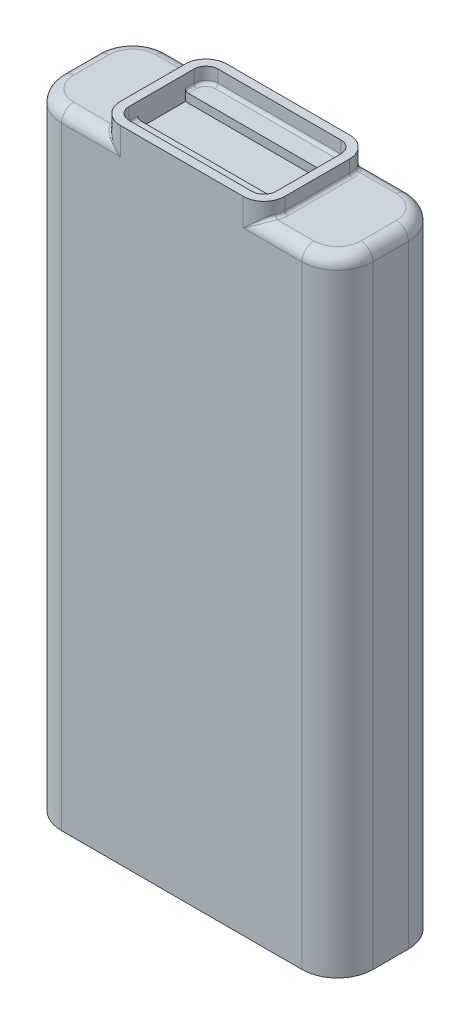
ISO-10303-21;
HEADER;
FILE_DESCRIPTION(('STEP AP214'),'2;1');
FILE_NAME('part.step','',(''),(''),'','','');
FILE_SCHEMA(('AUTOMOTIVE_DESIGN { 1 0 10303 214 1 1 1 1 }'));
ENDSEC;
DATA;
#1=APPLICATION_CONTEXT('core data for automotive mechanical design processes');
#2=APPLICATION_PROTOCOL_DEFINITION('international standard','automotive_design',2000,#1);
#3=PRODUCT_CONTEXT('',#1,'mechanical');
#4=PRODUCT('Part','Part','',(#3));
#5=PRODUCT_RELATED_PRODUCT_CATEGORY('part','',(#4));
#6=PRODUCT_DEFINITION_FORMATION('','',#4);
#7=PRODUCT_DEFINITION_CONTEXT('part definition',#1,'design');
#8=PRODUCT_DEFINITION('design','',#6,#7);
#9=PRODUCT_DEFINITION_SHAPE('','',#8);
#10=(LENGTH_UNIT() NAMED_UNIT(*) SI_UNIT(.MILLI.,.METRE.));
#11=(NAMED_UNIT(*) PLANE_ANGLE_UNIT() SI_UNIT($,.RADIAN.));
#12=(NAMED_UNIT(*) SI_UNIT($,.STERADIAN.) SOLID_ANGLE_UNIT());
#13=UNCERTAINTY_MEASURE_WITH_UNIT(LENGTH_MEASURE(1.E-05),#10,'distance_accuracy_value','');
#14=(GEOMETRIC_REPRESENTATION_CONTEXT(3) GLOBAL_UNCERTAINTY_ASSIGNED_CONTEXT((#13)) GLOBAL_UNIT_ASSIGNED_CONTEXT((#10,
#11,#12)) REPRESENTATION_CONTEXT('',''));
#15=CARTESIAN_POINT('',(0.,0.,0.));
#16=DIRECTION('',(0.,0.,1.));
#17=DIRECTION('',(1.,0.,0.));
#18=AXIS2_PLACEMENT_3D('',#15,#16,#17);
#19=CARTESIAN_POINT('',(16.129,164.1348,8.50900000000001));
#20=DIRECTION('',(0.,1.,0.));
#21=DIRECTION('',(0.,0.,1.));
#22=AXIS2_PLACEMENT_3D('',#19,#20,#21);
#23=PLANE('',#22);
#24=DIRECTION('',(1.,0.,0.));
#25=VECTOR('',#24,1.);
#26=CARTESIAN_POINT('',(-19.304,164.1348,6.27));
#27=LINE('',#26,#25);
#28=CARTESIAN_POINT('',(-18.51025,164.1348,6.27));
#29=VERTEX_POINT('',#28);
#30=CARTESIAN_POINT('',(18.51025,164.1348,6.27));
#31=VERTEX_POINT('',#30);
#32=EDGE_CURVE('E883',#29,#31,#27,.T.);
#33=ORIENTED_EDGE('',*,*,#32,.F.);
#34=DIRECTION('',(0.,0.,1.));
#35=VECTOR('',#34,1.);
#36=CARTESIAN_POINT('',(-18.51025,164.1348,8.50900000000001));
#37=LINE('',#36,#35);
#38=CARTESIAN_POINT('',(-18.51025,164.1348,8.50900000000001));
#39=VERTEX_POINT('',#38);
#40=EDGE_CURVE('E605',#29,#39,#37,.T.);
#41=ORIENTED_EDGE('',*,*,#40,.T.);
#42=CARTESIAN_POINT('',(-16.129,164.1348,8.50900000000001));
#43=DIRECTION('',(0.,1.,0.));
#44=DIRECTION('',(0.,0.,1.));
#45=AXIS2_PLACEMENT_3D('',#42,#43,#44);
#46=CIRCLE('',#45,2.38125);
#47=CARTESIAN_POINT('',(-16.129,164.1348,10.89025));
#48=VERTEX_POINT('',#47);
#49=EDGE_CURVE('E603',#39,#48,#46,.T.);
#50=ORIENTED_EDGE('',*,*,#49,.T.);
#51=DIRECTION('',(1.,0.,0.));
#52=VECTOR('',#51,1.);
#53=CARTESIAN_POINT('',(16.129,164.1348,10.89025));
#54=LINE('',#53,#52);
#55=CARTESIAN_POINT('',(16.129,164.1348,10.89025));
#56=VERTEX_POINT('',#55);
#57=EDGE_CURVE('E575',#48,#56,#54,.T.);
#58=ORIENTED_EDGE('',*,*,#57,.T.);
#59=CARTESIAN_POINT('',(16.129,164.1348,8.50900000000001));
#60=DIRECTION('',(0.,1.,0.));
#61=DIRECTION('',(0.,0.,1.));
#62=AXIS2_PLACEMENT_3D('',#59,#60,#61);
#63=CIRCLE('',#62,2.38125);
#64=CARTESIAN_POINT('',(18.51025,164.1348,8.50900000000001));
#65=VERTEX_POINT('',#64);
#66=EDGE_CURVE('E599',#56,#65,#63,.T.);
#67=ORIENTED_EDGE('',*,*,#66,.T.);
#68=DIRECTION('',(0.,0.,-1.));
#69=VECTOR('',#68,1.);
#70=CARTESIAN_POINT('',(18.51025,164.1348,8.50900000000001));
#71=LINE('',#70,#69);
#72=EDGE_CURVE('E601',#65,#31,#71,.T.);
#73=ORIENTED_EDGE('',*,*,#72,.T.);
#74=EDGE_LOOP('',(#33,#41,#50,#58,#67,#73));
#75=FACE_BOUND('',#74,.T.);
#76=ADVANCED_FACE('F41',(#75),#23,.T.);
#77=CARTESIAN_POINT('',(31.5722,168.148,-4.6482));
#78=DIRECTION('',(0.,-1.,0.));
#79=DIRECTION('',(0.,0.,-1.));
#80=AXIS2_PLACEMENT_3D('',#77,#78,#79);
#81=CYLINDRICAL_SURFACE('',#80,9.3218);
#82=DIRECTION('',(0.,-1.,0.));
#83=VECTOR('',#82,1.);
#84=CARTESIAN_POINT('',(31.5722,168.148,-13.97));
#85=LINE('',#84,#83);
#86=CARTESIAN_POINT('',(31.5722,160.9598,-13.97));
#87=VERTEX_POINT('',#86);
#88=CARTESIAN_POINT('',(31.5722,0.,-13.97));
#89=VERTEX_POINT('',#88);
#90=EDGE_CURVE('E520',#87,#89,#85,.T.);
#91=ORIENTED_EDGE('',*,*,#90,.F.);
#92=CARTESIAN_POINT('',(31.5722,160.9598,-4.6482));
#93=DIRECTION('',(0.,1.,0.));
#94=DIRECTION('',(0.,0.,1.));
#95=AXIS2_PLACEMENT_3D('',#92,#93,#94);
#96=CIRCLE('',#95,9.3218);
#97=CARTESIAN_POINT('',(40.894,160.9598,-4.6482));
#98=VERTEX_POINT('',#97);
#99=EDGE_CURVE('E568',#87,#98,#96,.F.);
#100=ORIENTED_EDGE('',*,*,#99,.T.);
#101=DIRECTION('',(0.,-1.,0.));
#102=VECTOR('',#101,1.);
#103=CARTESIAN_POINT('',(40.894,168.148,-4.6482));
#104=LINE('',#103,#102);
#105=CARTESIAN_POINT('',(40.894,0.,-4.6482));
#106=VERTEX_POINT('',#105);
#107=EDGE_CURVE('E477',#98,#106,#104,.T.);
#108=ORIENTED_EDGE('',*,*,#107,.T.);
#109=CARTESIAN_POINT('',(31.5722,0.,-4.6482));
#110=DIRECTION('',(0.,1.,0.));
#111=DIRECTION('',(0.,0.,-1.));
#112=AXIS2_PLACEMENT_3D('',#109,#110,#111);
#113=CIRCLE('',#112,9.3218);
#114=EDGE_CURVE('E463',#106,#89,#113,.T.);
#115=ORIENTED_EDGE('',*,*,#114,.T.);
#116=EDGE_LOOP('',(#91,#100,#108,#115));
#117=FACE_BOUND('',#116,.T.);
#118=ADVANCED_FACE('F792',(#117),#81,.T.);
#119=CARTESIAN_POINT('',(-31.5722,168.148,-13.97));
#120=DIRECTION('',(0.,0.,1.));
#121=DIRECTION('',(1.,0.,0.));
#122=AXIS2_PLACEMENT_3D('',#119,#120,#121);
#123=PLANE('',#122);
#124=DIRECTION('',(0.,-1.,0.));
#125=VECTOR('',#124,1.);
#126=CARTESIAN_POINT('',(-31.5722,168.148,-13.97));
#127=LINE('',#126,#125);
#128=CARTESIAN_POINT('',(-31.5722,160.9598,-13.97));
#129=VERTEX_POINT('',#128);
#130=CARTESIAN_POINT('',(-31.5722,0.,-13.97));
#131=VERTEX_POINT('',#130);
#132=EDGE_CURVE('E517',#129,#131,#127,.T.);
#133=ORIENTED_EDGE('',*,*,#132,.F.);
#134=DIRECTION('',(-1.,0.,0.));
#135=VECTOR('',#134,1.);
#136=CARTESIAN_POINT('',(-16.129,160.9598,-13.97));
#137=LINE('',#136,#135);
#138=CARTESIAN_POINT('',(-16.129,160.9598,-13.97));
#139=VERTEX_POINT('',#138);
#140=EDGE_CURVE('E539',#129,#139,#137,.F.);
#141=ORIENTED_EDGE('',*,*,#140,.T.);
#142=DIRECTION('',(0.,1.,0.));
#143=VECTOR('',#142,1.);
#144=CARTESIAN_POINT('',(-16.129,164.1348,-13.97));
#145=LINE('',#144,#143);
#146=CARTESIAN_POINT('',(-16.129,168.148,-13.97));
#147=VERTEX_POINT('',#146);
#148=EDGE_CURVE('E459',#139,#147,#145,.T.);
#149=ORIENTED_EDGE('',*,*,#148,.T.);
#150=DIRECTION('',(-1.,0.,0.));
#151=VECTOR('',#150,1.);
#152=CARTESIAN_POINT('',(-31.5722,168.148,-13.97));
#153=LINE('',#152,#151);
#154=CARTESIAN_POINT('',(16.129,168.148,-13.97));
#155=VERTEX_POINT('',#154);
#156=EDGE_CURVE('E470',#155,#147,#153,.T.);
#157=ORIENTED_EDGE('',*,*,#156,.F.);
#158=DIRECTION('',(0.,1.,0.));
#159=VECTOR('',#158,1.);
#160=CARTESIAN_POINT('',(16.129,164.1348,-13.97));
#161=LINE('',#160,#159);
#162=CARTESIAN_POINT('',(16.129,160.9598,-13.97));
#163=VERTEX_POINT('',#162);
#164=EDGE_CURVE('E441',#163,#155,#161,.T.);
#165=ORIENTED_EDGE('',*,*,#164,.F.);
#166=DIRECTION('',(-1.,0.,0.));
#167=VECTOR('',#166,1.);
#168=CARTESIAN_POINT('',(31.5722,160.9598,-13.97));
#169=LINE('',#168,#167);
#170=EDGE_CURVE('E537',#163,#87,#169,.F.);
#171=ORIENTED_EDGE('',*,*,#170,.T.);
#172=ORIENTED_EDGE('',*,*,#90,.T.);
#173=DIRECTION('',(-1.,0.,0.));
#174=VECTOR('',#173,1.);
#175=CARTESIAN_POINT('',(-31.5722,0.,-13.97));
#176=LINE('',#175,#174);
#177=EDGE_CURVE('E480',#89,#131,#176,.T.);
#178=ORIENTED_EDGE('',*,*,#177,.T.);
#179=EDGE_LOOP('',(#133,#141,#149,#157,#165,#171,#172,#178));
#180=FACE_BOUND('',#179,.T.);
#181=ADVANCED_FACE('F860',(#180),#123,.F.);
#182=CARTESIAN_POINT('',(-31.5722,168.148,-4.6482));
#183=DIRECTION('',(0.,-1.,0.));
#184=DIRECTION('',(0.,0.,-1.));
#185=AXIS2_PLACEMENT_3D('',#182,#183,#184);
#186=CYLINDRICAL_SURFACE('',#185,9.3218);
#187=DIRECTION('',(0.,-1.,0.));
#188=VECTOR('',#187,1.);
#189=CARTESIAN_POINT('',(-40.894,168.148,-4.6482));
#190=LINE('',#189,#188);
#191=CARTESIAN_POINT('',(-40.894,160.9598,-4.6482));
#192=VERTEX_POINT('',#191);
#193=CARTESIAN_POINT('',(-40.894,0.,-4.6482));
#194=VERTEX_POINT('',#193);
#195=EDGE_CURVE('E514',#192,#194,#190,.T.);
#196=ORIENTED_EDGE('',*,*,#195,.F.);
#197=CARTESIAN_POINT('',(-31.5722,160.9598,-4.6482));
#198=DIRECTION('',(0.,1.,0.));
#199=DIRECTION('',(0.,0.,1.));
#200=AXIS2_PLACEMENT_3D('',#197,#198,#199);
#201=CIRCLE('',#200,9.3218);
#202=EDGE_CURVE('E543',#192,#129,#201,.F.);
#203=ORIENTED_EDGE('',*,*,#202,.T.);
#204=ORIENTED_EDGE('',*,*,#132,.T.);
#205=CARTESIAN_POINT('',(-31.5722,0.,-4.6482));
#206=DIRECTION('',(0.,1.,0.));
#207=DIRECTION('',(0.,0.,-1.));
#208=AXIS2_PLACEMENT_3D('',#205,#206,#207);
#209=CIRCLE('',#208,9.3218);
#210=EDGE_CURVE('E484',#131,#194,#209,.T.);
#211=ORIENTED_EDGE('',*,*,#210,.T.);
#212=EDGE_LOOP('',(#196,#203,#204,#211));
#213=FACE_BOUND('',#212,.T.);
#214=ADVANCED_FACE('F1151',(#213),#186,.T.);
#215=CARTESIAN_POINT('',(-40.894,168.148,4.6482));
#216=DIRECTION('',(1.,0.,0.));
#217=DIRECTION('',(0.,0.,-1.));
#218=AXIS2_PLACEMENT_3D('',#215,#216,#217);
#219=PLANE('',#218);
#220=DIRECTION('',(0.,-1.,0.));
#221=VECTOR('',#220,1.);
#222=CARTESIAN_POINT('',(-40.894,168.148,4.6482));
#223=LINE('',#222,#221);
#224=CARTESIAN_POINT('',(-40.894,160.9598,4.6482));
#225=VERTEX_POINT('',#224);
#226=CARTESIAN_POINT('',(-40.894,0.,4.6482));
#227=VERTEX_POINT('',#226);
#228=EDGE_CURVE('E511',#225,#227,#223,.T.);
#229=ORIENTED_EDGE('',*,*,#228,.F.);
#230=DIRECTION('',(0.,0.,1.));
#231=VECTOR('',#230,1.);
#232=CARTESIAN_POINT('',(-40.894,160.9598,-4.6482));
#233=LINE('',#232,#231);
#234=EDGE_CURVE('E570',#225,#192,#233,.F.);
#235=ORIENTED_EDGE('',*,*,#234,.T.);
#236=ORIENTED_EDGE('',*,*,#195,.T.);
#237=DIRECTION('',(0.,0.,1.));
#238=VECTOR('',#237,1.);
#239=CARTESIAN_POINT('',(-40.894,0.,4.6482));
#240=LINE('',#239,#238);
#241=EDGE_CURVE('E488',#194,#227,#240,.T.);
#242=ORIENTED_EDGE('',*,*,#241,.T.);
#243=EDGE_LOOP('',(#229,#235,#236,#242));
#244=FACE_BOUND('',#243,.T.);
#245=ADVANCED_FACE('F1067',(#244),#219,.F.);
#246=CARTESIAN_POINT('',(-31.5722,168.148,4.6482));
#247=DIRECTION('',(0.,-1.,0.));
#248=DIRECTION('',(0.,0.,-1.));
#249=AXIS2_PLACEMENT_3D('',#246,#247,#248);
#250=CYLINDRICAL_SURFACE('',#249,9.3218);
#251=DIRECTION('',(0.,-1.,0.));
#252=VECTOR('',#251,1.);
#253=CARTESIAN_POINT('',(-31.5722,168.148,13.97));
#254=LINE('',#253,#252);
#255=CARTESIAN_POINT('',(-31.5722,160.9598,13.97));
#256=VERTEX_POINT('',#255);
#257=CARTESIAN_POINT('',(-31.5722,0.,13.97));
#258=VERTEX_POINT('',#257);
#259=EDGE_CURVE('E508',#256,#258,#254,.T.);
#260=ORIENTED_EDGE('',*,*,#259,.F.);
#261=CARTESIAN_POINT('',(-31.5722,160.9598,4.6482));
#262=DIRECTION('',(0.,1.,0.));
#263=DIRECTION('',(0.,0.,1.));
#264=AXIS2_PLACEMENT_3D('',#261,#262,#263);
#265=CIRCLE('',#264,9.3218);
#266=EDGE_CURVE('E552',#256,#225,#265,.F.);
#267=ORIENTED_EDGE('',*,*,#266,.T.);
#268=ORIENTED_EDGE('',*,*,#228,.T.);
#269=CARTESIAN_POINT('',(-31.5722,0.,4.6482));
#270=DIRECTION('',(0.,1.,0.));
#271=DIRECTION('',(0.,0.,-1.));
#272=AXIS2_PLACEMENT_3D('',#269,#270,#271);
#273=CIRCLE('',#272,9.3218);
#274=EDGE_CURVE('E492',#227,#258,#273,.T.);
#275=ORIENTED_EDGE('',*,*,#274,.T.);
#276=EDGE_LOOP('',(#260,#267,#268,#275));
#277=FACE_BOUND('',#276,.T.);
#278=ADVANCED_FACE('F1065',(#277),#250,.T.);
#279=CARTESIAN_POINT('',(-31.5722,168.148,13.97));
#280=DIRECTION('',(0.,0.,-1.));
#281=DIRECTION('',(-1.,0.,0.));
#282=AXIS2_PLACEMENT_3D('',#279,#280,#281);
#283=PLANE('',#282);
#284=DIRECTION('',(0.,1.,0.));
#285=VECTOR('',#284,1.);
#286=CARTESIAN_POINT('',(-16.129,164.1348,13.97));
#287=LINE('',#286,#285);
#288=CARTESIAN_POINT('',(-16.129,160.9598,13.97));
#289=VERTEX_POINT('',#288);
#290=CARTESIAN_POINT('',(-16.129,168.148,13.97));
#291=VERTEX_POINT('',#290);
#292=EDGE_CURVE('E458',#289,#291,#287,.T.);
#293=ORIENTED_EDGE('',*,*,#292,.F.);
#294=DIRECTION('',(1.,0.,0.));
#295=VECTOR('',#294,1.);
#296=CARTESIAN_POINT('',(-31.5722,160.9598,13.97));
#297=LINE('',#296,#295);
#298=EDGE_CURVE('E549',#289,#256,#297,.F.);
#299=ORIENTED_EDGE('',*,*,#298,.T.);
#300=ORIENTED_EDGE('',*,*,#259,.T.);
#301=DIRECTION('',(1.,0.,0.));
#302=VECTOR('',#301,1.);
#303=CARTESIAN_POINT('',(-31.5722,0.,13.97));
#304=LINE('',#303,#302);
#305=CARTESIAN_POINT('',(31.5722,0.,13.97));
#306=VERTEX_POINT('',#305);
#307=EDGE_CURVE('E495',#258,#306,#304,.T.);
#308=ORIENTED_EDGE('',*,*,#307,.T.);
#309=DIRECTION('',(0.,-1.,0.));
#310=VECTOR('',#309,1.);
#311=CARTESIAN_POINT('',(31.5722,168.148,13.97));
#312=LINE('',#311,#310);
#313=CARTESIAN_POINT('',(31.5722,160.9598,13.97));
#314=VERTEX_POINT('',#313);
#315=EDGE_CURVE('E506',#314,#306,#312,.T.);
#316=ORIENTED_EDGE('',*,*,#315,.F.);
#317=DIRECTION('',(1.,0.,0.));
#318=VECTOR('',#317,1.);
#319=CARTESIAN_POINT('',(16.129,160.9598,13.97));
#320=LINE('',#319,#318);
#321=CARTESIAN_POINT('',(16.129,160.9598,13.97));
#322=VERTEX_POINT('',#321);
#323=EDGE_CURVE('E546',#314,#322,#320,.F.);
#324=ORIENTED_EDGE('',*,*,#323,.T.);
#325=DIRECTION('',(0.,1.,0.));
#326=VECTOR('',#325,1.);
#327=CARTESIAN_POINT('',(16.129,164.1348,13.97));
#328=LINE('',#327,#326);
#329=CARTESIAN_POINT('',(16.129,168.148,13.97));
#330=VERTEX_POINT('',#329);
#331=EDGE_CURVE('E442',#322,#330,#328,.T.);
#332=ORIENTED_EDGE('',*,*,#331,.T.);
#333=DIRECTION('',(1.,0.,0.));
#334=VECTOR('',#333,1.);
#335=CARTESIAN_POINT('',(-31.5722,168.148,13.97));
#336=LINE('',#335,#334);
#337=EDGE_CURVE('E473',#291,#330,#336,.T.);
#338=ORIENTED_EDGE('',*,*,#337,.F.);
#339=EDGE_LOOP('',(#293,#299,#300,#308,#316,#324,#332,#338));
#340=FACE_BOUND('',#339,.T.);
#341=ADVANCED_FACE('F1052',(#340),#283,.F.);
#342=CARTESIAN_POINT('',(31.5722,168.148,4.6482));
#343=DIRECTION('',(0.,-1.,0.));
#344=DIRECTION('',(0.,0.,-1.));
#345=AXIS2_PLACEMENT_3D('',#342,#343,#344);
#346=CYLINDRICAL_SURFACE('',#345,9.3218);
#347=DIRECTION('',(0.,-1.,0.));
#348=VECTOR('',#347,1.);
#349=CARTESIAN_POINT('',(40.894,168.148,4.6482));
#350=LINE('',#349,#348);
#351=CARTESIAN_POINT('',(40.894,160.9598,4.6482));
#352=VERTEX_POINT('',#351);
#353=CARTESIAN_POINT('',(40.894,0.,4.6482));
#354=VERTEX_POINT('',#353);
#355=EDGE_CURVE('E504',#352,#354,#350,.T.);
#356=ORIENTED_EDGE('',*,*,#355,.F.);
#357=CARTESIAN_POINT('',(31.5722,160.9598,4.6482));
#358=DIRECTION('',(0.,1.,0.));
#359=DIRECTION('',(0.,0.,1.));
#360=AXIS2_PLACEMENT_3D('',#357,#358,#359);
#361=CIRCLE('',#360,9.3218);
#362=EDGE_CURVE('E566',#352,#314,#361,.F.);
#363=ORIENTED_EDGE('',*,*,#362,.T.);
#364=ORIENTED_EDGE('',*,*,#315,.T.);
#365=CARTESIAN_POINT('',(31.5722,0.,4.6482));
#366=DIRECTION('',(0.,1.,0.));
#367=DIRECTION('',(0.,0.,1.));
#368=AXIS2_PLACEMENT_3D('',#365,#366,#367);
#369=CIRCLE('',#368,9.3218);
#370=EDGE_CURVE('E498',#306,#354,#369,.T.);
#371=ORIENTED_EDGE('',*,*,#370,.T.);
#372=EDGE_LOOP('',(#356,#363,#364,#371));
#373=FACE_BOUND('',#372,.T.);
#374=ADVANCED_FACE('F1448',(#373),#346,.T.);
#375=CARTESIAN_POINT('',(40.894,168.148,4.6482));
#376=DIRECTION('',(-1.,0.,0.));
#377=DIRECTION('',(0.,0.,1.));
#378=AXIS2_PLACEMENT_3D('',#375,#376,#377);
#379=PLANE('',#378);
#380=ORIENTED_EDGE('',*,*,#107,.F.);
#381=DIRECTION('',(0.,0.,-1.));
#382=VECTOR('',#381,1.);
#383=CARTESIAN_POINT('',(40.894,160.9598,4.6482));
#384=LINE('',#383,#382);
#385=EDGE_CURVE('E573',#98,#352,#384,.F.);
#386=ORIENTED_EDGE('',*,*,#385,.T.);
#387=ORIENTED_EDGE('',*,*,#355,.T.);
#388=DIRECTION('',(0.,0.,-1.));
#389=VECTOR('',#388,1.);
#390=CARTESIAN_POINT('',(40.894,0.,4.6482));
#391=LINE('',#390,#389);
#392=EDGE_CURVE('E474',#354,#106,#391,.T.);
#393=ORIENTED_EDGE('',*,*,#392,.T.);
#394=EDGE_LOOP('',(#380,#386,#387,#393));
#395=FACE_BOUND('',#394,.T.);
#396=ADVANCED_FACE('F1509',(#395),#379,.F.);
#397=CARTESIAN_POINT('',(31.5722,168.148,-4.6482));
#398=DIRECTION('',(0.,-1.,0.));
#399=DIRECTION('',(0.,0.,-1.));
#400=AXIS2_PLACEMENT_3D('',#397,#398,#399);
#401=PLANE('',#400);
#402=DIRECTION('',(0.,0.,-1.));
#403=VECTOR('',#402,1.);
#404=CARTESIAN_POINT('',(19.304,168.148,8.50900000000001));
#405=LINE('',#404,#403);
#406=CARTESIAN_POINT('',(19.304,168.148,8.50900000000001));
#407=VERTEX_POINT('',#406);
#408=CARTESIAN_POINT('',(19.304,168.148,-8.509));
#409=VERTEX_POINT('',#408);
#410=EDGE_CURVE('E393',#407,#409,#405,.T.);
#411=ORIENTED_EDGE('',*,*,#410,.F.);
#412=CARTESIAN_POINT('',(16.129,168.148,8.50900000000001));
#413=DIRECTION('',(0.,1.,0.));
#414=DIRECTION('',(0.,0.,1.));
#415=AXIS2_PLACEMENT_3D('',#412,#413,#414);
#416=CIRCLE('',#415,3.175);
#417=CARTESIAN_POINT('',(16.129,168.148,11.684));
#418=VERTEX_POINT('',#417);
#419=EDGE_CURVE('E390',#418,#407,#416,.T.);
#420=ORIENTED_EDGE('',*,*,#419,.F.);
#421=DIRECTION('',(1.,0.,0.));
#422=VECTOR('',#421,1.);
#423=CARTESIAN_POINT('',(-16.129,168.148,11.684));
#424=LINE('',#423,#422);
#425=CARTESIAN_POINT('',(-16.129,168.148,11.684));
#426=VERTEX_POINT('',#425);
#427=EDGE_CURVE('E412',#426,#418,#424,.T.);
#428=ORIENTED_EDGE('',*,*,#427,.F.);
#429=CARTESIAN_POINT('',(-16.129,168.148,8.50900000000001));
#430=DIRECTION('',(0.,1.,0.));
#431=DIRECTION('',(0.,0.,-1.));
#432=AXIS2_PLACEMENT_3D('',#429,#430,#431);
#433=CIRCLE('',#432,3.175);
#434=CARTESIAN_POINT('',(-19.304,168.148,8.50900000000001));
#435=VERTEX_POINT('',#434);
#436=EDGE_CURVE('E409',#435,#426,#433,.T.);
#437=ORIENTED_EDGE('',*,*,#436,.F.);
#438=DIRECTION('',(0.,0.,1.));
#439=VECTOR('',#438,1.);
#440=CARTESIAN_POINT('',(-19.304,168.148,8.50900000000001));
#441=LINE('',#440,#439);
#442=CARTESIAN_POINT('',(-19.304,168.148,-8.509));
#443=VERTEX_POINT('',#442);
#444=EDGE_CURVE('E406',#443,#435,#441,.T.);
#445=ORIENTED_EDGE('',*,*,#444,.F.);
#446=CARTESIAN_POINT('',(-16.129,168.148,-8.509));
#447=DIRECTION('',(0.,1.,0.));
#448=DIRECTION('',(0.,0.,-1.));
#449=AXIS2_PLACEMENT_3D('',#446,#447,#448);
#450=CIRCLE('',#449,3.175);
#451=CARTESIAN_POINT('',(-16.129,168.148,-11.684));
#452=VERTEX_POINT('',#451);
#453=EDGE_CURVE('E403',#452,#443,#450,.T.);
#454=ORIENTED_EDGE('',*,*,#453,.F.);
#455=DIRECTION('',(-1.,0.,0.));
#456=VECTOR('',#455,1.);
#457=CARTESIAN_POINT('',(-16.129,168.148,-11.684));
#458=LINE('',#457,#456);
#459=CARTESIAN_POINT('',(16.129,168.148,-11.684));
#460=VERTEX_POINT('',#459);
#461=EDGE_CURVE('E400',#460,#452,#458,.T.);
#462=ORIENTED_EDGE('',*,*,#461,.F.);
#463=CARTESIAN_POINT('',(16.129,168.148,-8.509));
#464=DIRECTION('',(0.,1.,0.));
#465=DIRECTION('',(0.,0.,-1.));
#466=AXIS2_PLACEMENT_3D('',#463,#464,#465);
#467=CIRCLE('',#466,3.175);
#468=EDGE_CURVE('E397',#409,#460,#467,.T.);
#469=ORIENTED_EDGE('',*,*,#468,.F.);
#470=EDGE_LOOP('',(#411,#420,#428,#437,#445,#454,#462,#469));
#471=FACE_BOUND('',#470,.T.);
#472=ORIENTED_EDGE('',*,*,#337,.T.);
#473=CARTESIAN_POINT('',(16.129,168.148,8.509));
#474=DIRECTION('',(0.,-1.,0.));
#475=DIRECTION('',(0.,0.,1.));
#476=AXIS2_PLACEMENT_3D('',#473,#474,#475);
#477=CIRCLE('',#476,5.461);
#478=CARTESIAN_POINT('',(21.59,168.148,8.509));
#479=VERTEX_POINT('',#478);
#480=EDGE_CURVE('E439',#479,#330,#477,.T.);
#481=ORIENTED_EDGE('',*,*,#480,.F.);
#482=DIRECTION('',(0.,0.,1.));
#483=VECTOR('',#482,1.);
#484=CARTESIAN_POINT('',(21.59,168.148,8.509));
#485=LINE('',#484,#483);
#486=CARTESIAN_POINT('',(21.59,168.148,-8.509));
#487=VERTEX_POINT('',#486);
#488=EDGE_CURVE('E436',#487,#479,#485,.T.);
#489=ORIENTED_EDGE('',*,*,#488,.F.);
#490=CARTESIAN_POINT('',(16.129,168.148,-8.509));
#491=DIRECTION('',(0.,-1.,0.));
#492=DIRECTION('',(0.,0.,-1.));
#493=AXIS2_PLACEMENT_3D('',#490,#491,#492);
#494=CIRCLE('',#493,5.461);
#495=EDGE_CURVE('E418',#155,#487,#494,.T.);
#496=ORIENTED_EDGE('',*,*,#495,.F.);
#497=ORIENTED_EDGE('',*,*,#156,.T.);
#498=CARTESIAN_POINT('',(-16.129,168.148,-8.509));
#499=DIRECTION('',(0.,-1.,0.));
#500=DIRECTION('',(0.,0.,-1.));
#501=AXIS2_PLACEMENT_3D('',#498,#499,#500);
#502=CIRCLE('',#501,5.461);
#503=CARTESIAN_POINT('',(-21.59,168.148,-8.509));
#504=VERTEX_POINT('',#503);
#505=EDGE_CURVE('E456',#504,#147,#502,.T.);
#506=ORIENTED_EDGE('',*,*,#505,.F.);
#507=DIRECTION('',(0.,0.,-1.));
#508=VECTOR('',#507,1.);
#509=CARTESIAN_POINT('',(-21.59,168.148,8.509));
#510=LINE('',#509,#508);
#511=CARTESIAN_POINT('',(-21.59,168.148,8.509));
#512=VERTEX_POINT('',#511);
#513=EDGE_CURVE('E453',#512,#504,#510,.T.);
#514=ORIENTED_EDGE('',*,*,#513,.F.);
#515=CARTESIAN_POINT('',(-16.129,168.148,8.509));
#516=DIRECTION('',(0.,-1.,0.));
#517=DIRECTION('',(0.,0.,-1.));
#518=AXIS2_PLACEMENT_3D('',#515,#516,#517);
#519=CIRCLE('',#518,5.461);
#520=EDGE_CURVE('E445',#291,#512,#519,.T.);
#521=ORIENTED_EDGE('',*,*,#520,.F.);
#522=EDGE_LOOP('',(#472,#481,#489,#496,#497,#506,#514,#521));
#523=FACE_BOUND('',#522,.T.);
#524=ADVANCED_FACE('F961',(#471,#523),#401,.F.);
#525=CARTESIAN_POINT('',(31.5722,0.,-4.6482));
#526=DIRECTION('',(0.,-1.,0.));
#527=DIRECTION('',(0.,0.,-1.));
#528=AXIS2_PLACEMENT_3D('',#525,#526,#527);
#529=PLANE('',#528);
#530=ORIENTED_EDGE('',*,*,#114,.F.);
#531=ORIENTED_EDGE('',*,*,#392,.F.);
#532=ORIENTED_EDGE('',*,*,#370,.F.);
#533=ORIENTED_EDGE('',*,*,#307,.F.);
#534=ORIENTED_EDGE('',*,*,#274,.F.);
#535=ORIENTED_EDGE('',*,*,#241,.F.);
#536=ORIENTED_EDGE('',*,*,#210,.F.);
#537=ORIENTED_EDGE('',*,*,#177,.F.);
#538=EDGE_LOOP('',(#530,#531,#532,#533,#534,#535,#536,#537));
#539=FACE_BOUND('',#538,.T.);
#540=ADVANCED_FACE('F1075',(#539),#529,.T.);
#541=CARTESIAN_POINT('',(-16.129,164.1348,-8.509));
#542=DIRECTION('',(0.,1.,0.));
#543=DIRECTION('',(0.,0.,1.));
#544=AXIS2_PLACEMENT_3D('',#541,#542,#543);
#545=CYLINDRICAL_SURFACE('',#544,5.461);
#546=ORIENTED_EDGE('',*,*,#148,.F.);
#547=CARTESIAN_POINT('',(-22.2737640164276,164.006174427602,-9.90044544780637));
#548=CARTESIAN_POINT('',(-21.450673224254,163.963886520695,-9.75643545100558));
#549=CARTESIAN_POINT('',(-21.493971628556,164.767768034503,-9.52860797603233));
#550=CARTESIAN_POINT('',(-22.2560676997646,164.02808823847,-9.97502024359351));
#551=CARTESIAN_POINT('',(-21.4354747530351,163.985603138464,-9.81746170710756));
#552=CARTESIAN_POINT('',(-21.4785210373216,164.795160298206,-9.60999671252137));
#553=CARTESIAN_POINT('',(-22.2360221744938,164.047136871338,-10.0500694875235));
#554=CARTESIAN_POINT('',(-21.4192409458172,164.005464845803,-9.87875092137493));
#555=CARTESIAN_POINT('',(-21.4610193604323,164.818971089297,-9.69190324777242));
#556=CARTESIAN_POINT('',(-22.1912530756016,164.079578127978,-10.2004442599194));
#557=CARTESIAN_POINT('',(-21.3844176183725,164.041488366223,-10.00220360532));
#558=CARTESIAN_POINT('',(-21.4219316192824,164.859522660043,-9.85601784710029));
#559=CARTESIAN_POINT('',(-22.1665325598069,164.092974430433,-10.2757695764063));
#560=CARTESIAN_POINT('',(-21.3658742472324,164.057621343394,-10.0642265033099));
#561=CARTESIAN_POINT('',(-21.4003482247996,164.876268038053,-9.9382256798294));
#562=CARTESIAN_POINT('',(-22.1125953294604,164.114141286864,-10.4256099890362));
#563=CARTESIAN_POINT('',(-21.3263738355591,164.086114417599,-10.1888797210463));
#564=CARTESIAN_POINT('',(-21.353255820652,164.902726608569,-10.1017570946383));
#565=CARTESIAN_POINT('',(-22.0834104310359,164.121949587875,-10.50012710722));
#566=CARTESIAN_POINT('',(-21.3054885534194,164.09848517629,-10.2513629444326));
#567=CARTESIAN_POINT('',(-21.3277745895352,164.912486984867,-10.1830828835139));
#568=CARTESIAN_POINT('',(-22.0205476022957,164.132279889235,-10.6483195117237));
#569=CARTESIAN_POINT('',(-21.2609620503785,164.119477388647,-10.3773695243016));
#570=CARTESIAN_POINT('',(-21.272889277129,164.925399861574,-10.344815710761));
#571=CARTESIAN_POINT('',(-21.9868686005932,164.134800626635,-10.7219945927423));
#572=CARTESIAN_POINT('',(-21.2373820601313,164.128101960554,-10.440762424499));
#573=CARTESIAN_POINT('',(-21.2434842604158,164.928550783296,-10.4252225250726));
#574=CARTESIAN_POINT('',(-21.9064244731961,164.134799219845,-10.8858909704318));
#575=CARTESIAN_POINT('',(-21.1811401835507,164.14306073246,-10.5839978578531));
#576=CARTESIAN_POINT('',(-21.1732487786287,164.928549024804,-10.6040942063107));
#577=CARTESIAN_POINT('',(-21.8584747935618,164.130890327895,-10.9757439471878));
#578=CARTESIAN_POINT('',(-21.1477162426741,164.148372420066,-10.6640420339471));
#579=CARTESIAN_POINT('',(-21.1313840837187,164.923662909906,-10.7021570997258));
#580=CARTESIAN_POINT('',(-21.7563992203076,164.115850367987,-11.1525781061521));
#581=CARTESIAN_POINT('',(-21.0758557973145,164.152634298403,-10.8251239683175));
#582=CARTESIAN_POINT('',(-21.042262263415,164.904862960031,-10.8951486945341));
#583=CARTESIAN_POINT('',(-21.7022693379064,164.104714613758,-11.2395573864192));
#584=CARTESIAN_POINT('',(-21.0375562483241,164.151655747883,-10.9059768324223));
#585=CARTESIAN_POINT('',(-20.9950016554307,164.890943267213,-10.9900753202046));
#586=CARTESIAN_POINT('',(-21.5312279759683,164.061381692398,-11.4955474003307));
#587=CARTESIAN_POINT('',(-20.9154782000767,164.138917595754,-11.1476107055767));
#588=CARTESIAN_POINT('',(-20.8456660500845,164.836777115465,-11.269455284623));
#589=CARTESIAN_POINT('',(-21.4058033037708,164.019262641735,-11.6593305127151));
#590=CARTESIAN_POINT('',(-20.823704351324,164.117755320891,-11.3098927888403));
#591=CARTESIAN_POINT('',(-20.73615821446,164.784128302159,-11.4482033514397));
#592=CARTESIAN_POINT('',(-21.1053253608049,163.901560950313,-12.0065732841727));
#593=CARTESIAN_POINT('',(-20.595636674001,164.04111808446,-11.6653792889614));
#594=CARTESIAN_POINT('',(-20.4738119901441,164.637001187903,-11.8271738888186));
#595=CARTESIAN_POINT('',(-20.9255619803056,163.820403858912,-12.1854563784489));
#596=CARTESIAN_POINT('',(-20.4544184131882,163.979864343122,-11.858061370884));
#597=CARTESIAN_POINT('',(-20.3168612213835,164.535554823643,-12.0224016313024));
#598=CARTESIAN_POINT('',(-20.5465876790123,163.634841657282,-12.5156734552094));
#599=CARTESIAN_POINT('',(-20.14541940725,163.822860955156,-12.2231433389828));
#600=CARTESIAN_POINT('',(-19.9859801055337,164.303602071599,-12.3827908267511));
#601=CARTESIAN_POINT('',(-20.3473520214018,163.530406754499,-12.6669716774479));
#602=CARTESIAN_POINT('',(-19.9784132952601,163.728259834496,-12.3964853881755));
#603=CARTESIAN_POINT('',(-19.8120281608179,164.173058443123,-12.5479132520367));
#604=CARTESIAN_POINT('',(-19.8538874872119,163.260494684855,-12.9970789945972));
#605=CARTESIAN_POINT('',(-19.5577136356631,163.471652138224,-12.7770380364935));
#606=CARTESIAN_POINT('',(-19.3811860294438,163.835668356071,-12.9081826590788));
#607=CARTESIAN_POINT('',(-19.5531712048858,163.087182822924,-13.1632236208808));
#608=CARTESIAN_POINT('',(-19.2918884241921,163.296481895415,-12.977551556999));
#609=CARTESIAN_POINT('',(-19.1186317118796,163.619028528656,-13.0895080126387));
#610=CARTESIAN_POINT('',(-18.9354763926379,162.720693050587,-13.4471161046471));
#611=CARTESIAN_POINT('',(-18.7377255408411,162.913710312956,-13.3203509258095));
#612=CARTESIAN_POINT('',(-18.5793245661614,163.160916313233,-13.3993399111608));
#613=CARTESIAN_POINT('',(-18.6184694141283,162.527479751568,-13.5647758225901));
#614=CARTESIAN_POINT('',(-18.4473891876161,162.705292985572,-13.4662860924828));
#615=CARTESIAN_POINT('',(-18.3025468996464,162.919399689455,-13.5277502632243));
#616=CARTESIAN_POINT('',(-17.9443478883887,162.110381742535,-13.7640393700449));
#617=CARTESIAN_POINT('',(-17.8278687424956,162.250365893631,-13.7116249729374));
#618=CARTESIAN_POINT('',(-17.713973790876,162.398027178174,-13.7452206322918));
#619=CARTESIAN_POINT('',(-17.5862980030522,161.885331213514,-13.8411160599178));
#620=CARTESIAN_POINT('',(-17.49324812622,161.999189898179,-13.8088185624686));
#621=CARTESIAN_POINT('',(-17.401361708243,162.11671401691,-13.8293398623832));
#622=CARTESIAN_POINT('',(-16.8658011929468,161.429316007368,-13.9437482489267));
#623=CARTESIAN_POINT('',(-16.8212654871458,161.489688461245,-13.9367228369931));
#624=CARTESIAN_POINT('',(-16.7722985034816,161.546695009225,-13.9413496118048));
#625=CARTESIAN_POINT('',(-16.5033658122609,161.198365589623,-13.9694178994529));
#626=CARTESIAN_POINT('',(-16.4796364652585,161.228205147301,-13.9692683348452));
#627=CARTESIAN_POINT('',(-16.4558574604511,161.25800698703,-13.9693647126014));
#628=CARTESIAN_POINT('',(-16.1372479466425,160.965056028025,-13.9699967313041));
#629=CARTESIAN_POINT('',(-16.1367246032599,160.965713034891,-13.9699959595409));
#630=CARTESIAN_POINT('',(-16.1362012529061,160.966370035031,-13.9699964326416));
#631=CARTESIAN_POINT('',(-16.1331239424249,160.962427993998,-13.9699999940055));
#632=CARTESIAN_POINT('',(-16.132862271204,160.962756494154,-13.9700000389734));
#633=CARTESIAN_POINT('',(-16.1326005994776,160.963084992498,-13.9699999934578));
#634=CARTESIAN_POINT('',(-16.129,160.9598,-13.97));
#635=CARTESIAN_POINT('',(-16.129,160.9598,-13.97));
#636=CARTESIAN_POINT('',(-16.129,160.9598,-13.97));
#637=(BOUNDED_SURFACE() B_SPLINE_SURFACE(3,2,((#547,#548,#549),(#550,#551,#552),(#553,#554,
#555),(#556,#557,#558),(#559,#560,#561),(#562,#563,#564),(#565,#566,#567),(#568,#569,#570),
(#571,#572,#573),(#574,#575,#576),(#577,#578,#579),(#580,#581,#582),(#583,#584,#585),(#586,#587,
#588),(#589,#590,#591),(#592,#593,#594),(#595,#596,#597),(#598,#599,#600),(#601,#602,#603),
(#604,#605,#606),(#607,#608,#609),(#610,#611,#612),(#613,#614,#615),(#616,#617,#618),(#619,#620,
#621),(#622,#623,#624),(#625,#626,#627),(#628,#629,#630),(#631,#632,#633),(#634,#635,#636)),
.UNSPECIFIED.,.F.,.F.,.F.) B_SPLINE_SURFACE_WITH_KNOTS((4,2,2,2,2,2,2,2,2,2,2,2,2,2,4),(3,3),
(0.,0.296162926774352,0.592132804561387,0.886084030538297,1.18010545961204,1.54615907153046,
1.9124502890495,2.64614439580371,3.55423409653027,4.46349277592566,5.73116609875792,
7.00113383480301,8.3926159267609,9.78100473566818,9.79682213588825),(0.,1.),
.UNSPECIFIED.) GEOMETRIC_REPRESENTATION_ITEM() RATIONAL_B_SPLINE_SURFACE(((1.,0.688256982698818,
1.),(1.,0.688318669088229,1.),(1.,0.688773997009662,1.),(1.,0.690456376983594,1.),(1.,
0.691682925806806,1.),(1.,0.694881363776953,1.),(1.,0.696848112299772,1.),(1.,0.701475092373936,
1.),(1.,0.704135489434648,1.),(1.,0.710806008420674,1.),(1.,0.714987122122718,1.),(1.,
0.724140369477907,1.),(1.,0.729113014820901,1.),(1.,0.74495710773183,1.),(1.,0.756742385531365,
1.),(1.,0.784215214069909,1.),(1.,0.800164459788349,1.),(1.,0.831629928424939,1.),(1.,
0.847145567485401,1.),(1.,0.882386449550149,1.),(1.,0.901360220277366,1.),(1.,0.934701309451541,
1.),(1.,0.949060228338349,1.),(1.,0.973727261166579,1.),(1.,0.983516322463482,1.),(1.,
0.996607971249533,1.),(1.,0.99992492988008,1.),(1.,0.99999958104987,1.),(1.,1.00000000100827,
1.),(1.,1.,1.))) REPRESENTATION_ITEM('') SURFACE());
#638=CARTESIAN_POINT('',(-21.493971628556,164.767768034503,-9.52860797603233));
#639=CARTESIAN_POINT('',(-21.4785210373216,164.795160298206,-9.60999671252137));
#640=CARTESIAN_POINT('',(-21.4610193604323,164.818971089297,-9.69190324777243));
#641=CARTESIAN_POINT('',(-21.4219316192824,164.859522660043,-9.85601784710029));
#642=CARTESIAN_POINT('',(-21.4003482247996,164.876268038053,-9.9382256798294));
#643=CARTESIAN_POINT('',(-21.353255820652,164.902726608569,-10.1017570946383));
#644=CARTESIAN_POINT('',(-21.3277745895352,164.912486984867,-10.1830828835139));
#645=CARTESIAN_POINT('',(-21.272889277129,164.925399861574,-10.344815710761));
#646=CARTESIAN_POINT('',(-21.2434842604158,164.928550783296,-10.4252225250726));
#647=CARTESIAN_POINT('',(-21.1732487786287,164.928549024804,-10.6040942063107));
#648=CARTESIAN_POINT('',(-21.1313840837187,164.923662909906,-10.7021570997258));
#649=CARTESIAN_POINT('',(-21.042262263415,164.904862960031,-10.8951486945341));
#650=CARTESIAN_POINT('',(-20.9950016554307,164.890943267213,-10.9900753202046));
#651=CARTESIAN_POINT('',(-20.8456660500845,164.836777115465,-11.269455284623));
#652=CARTESIAN_POINT('',(-20.73615821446,164.784128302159,-11.4482033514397));
#653=CARTESIAN_POINT('',(-20.4738119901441,164.637001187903,-11.8271738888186));
#654=CARTESIAN_POINT('',(-20.3168612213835,164.535554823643,-12.0224016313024));
#655=CARTESIAN_POINT('',(-19.9859801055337,164.303602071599,-12.3827908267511));
#656=CARTESIAN_POINT('',(-19.8120281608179,164.173058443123,-12.5479132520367));
#657=CARTESIAN_POINT('',(-19.3811860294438,163.835668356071,-12.9081826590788));
#658=CARTESIAN_POINT('',(-19.1186317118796,163.619028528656,-13.0895080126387));
#659=CARTESIAN_POINT('',(-18.5793245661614,163.160916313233,-13.3993399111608));
#660=CARTESIAN_POINT('',(-18.3025468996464,162.919399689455,-13.5277502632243));
#661=CARTESIAN_POINT('',(-17.713973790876,162.398027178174,-13.7452206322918));
#662=CARTESIAN_POINT('',(-17.401361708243,162.11671401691,-13.8293398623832));
#663=CARTESIAN_POINT('',(-16.7722985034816,161.546695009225,-13.9413496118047));
#664=CARTESIAN_POINT('',(-16.4558574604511,161.258006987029,-13.9693647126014));
#665=CARTESIAN_POINT('',(-16.1362012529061,160.966370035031,-13.9699964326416));
#666=CARTESIAN_POINT('',(-16.1326005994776,160.963084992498,-13.9699999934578));
#667=CARTESIAN_POINT('',(-16.129,160.9598,-13.97));
#668=B_SPLINE_CURVE_WITH_KNOTS('',3,(#638,#639,#640,#641,#642,#643,#644,#645,#646,#647,#648,
#649,#650,#651,#652,#653,#654,#655,#656,#657,#658,#659,#660,#661,#662,#663,#664,#665,#666,#667),
.UNSPECIFIED.,.F.,.F.,(4,2,2,2,2,2,2,2,2,2,2,2,2,2,4),(0.,0.296162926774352,0.592132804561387,
0.886084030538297,1.18010545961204,1.54615907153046,1.9124502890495,2.64614439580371,
3.55423409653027,4.46349277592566,5.73116609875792,7.00113383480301,8.3926159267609,
9.78100473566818,9.79682213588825),.UNSPECIFIED.);
#669=CARTESIAN_POINT('',(-21.2121988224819,164.92855,-10.5048984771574));
#670=VERTEX_POINT('',#669);
#671=EDGE_CURVE('E65',#139,#670,#668,.F.);
#672=ORIENTED_EDGE('',*,*,#671,.T.);
#673=CARTESIAN_POINT('',(-16.129,164.92855,-8.509));
#674=DIRECTION('',(0.,1.,0.));
#675=DIRECTION('',(0.,0.,1.));
#676=AXIS2_PLACEMENT_3D('',#673,#674,#675);
#677=CIRCLE('',#676,5.461);
#678=CARTESIAN_POINT('',(-21.59,164.92855,-8.509));
#679=VERTEX_POINT('',#678);
#680=EDGE_CURVE('E73',#670,#679,#677,.T.);
#681=ORIENTED_EDGE('',*,*,#680,.T.);
#682=DIRECTION('',(0.,1.,0.));
#683=VECTOR('',#682,1.);
#684=CARTESIAN_POINT('',(-21.59,164.1348,-8.509));
#685=LINE('',#684,#683);
#686=EDGE_CURVE('E464',#679,#504,#685,.T.);
#687=ORIENTED_EDGE('',*,*,#686,.T.);
#688=ORIENTED_EDGE('',*,*,#505,.T.);
#689=EDGE_LOOP('',(#546,#672,#681,#687,#688));
#690=FACE_BOUND('',#689,.T.);
#691=ADVANCED_FACE('F783',(#690),#545,.T.);
#692=CARTESIAN_POINT('',(-21.59,164.1348,8.509));
#693=DIRECTION('',(1.,0.,0.));
#694=DIRECTION('',(0.,0.,-1.));
#695=AXIS2_PLACEMENT_3D('',#692,#693,#694);
#696=PLANE('',#695);
#697=ORIENTED_EDGE('',*,*,#686,.F.);
#698=DIRECTION('',(0.,0.,-1.));
#699=VECTOR('',#698,1.);
#700=CARTESIAN_POINT('',(-21.59,164.92855,8.509));
#701=LINE('',#700,#699);
#702=CARTESIAN_POINT('',(-21.59,164.92855,8.509));
#703=VERTEX_POINT('',#702);
#704=EDGE_CURVE('E926',#679,#703,#701,.F.);
#705=ORIENTED_EDGE('',*,*,#704,.T.);
#706=DIRECTION('',(0.,1.,0.));
#707=VECTOR('',#706,1.);
#708=CARTESIAN_POINT('',(-21.59,164.1348,8.509));
#709=LINE('',#708,#707);
#710=EDGE_CURVE('E467',#703,#512,#709,.T.);
#711=ORIENTED_EDGE('',*,*,#710,.T.);
#712=ORIENTED_EDGE('',*,*,#513,.T.);
#713=EDGE_LOOP('',(#697,#705,#711,#712));
#714=FACE_BOUND('',#713,.T.);
#715=ADVANCED_FACE('F1461',(#714),#696,.F.);
#716=CARTESIAN_POINT('',(-16.129,164.1348,8.509));
#717=DIRECTION('',(0.,1.,0.));
#718=DIRECTION('',(0.,0.,1.));
#719=AXIS2_PLACEMENT_3D('',#716,#717,#718);
#720=CYLINDRICAL_SURFACE('',#719,5.461);
#721=CARTESIAN_POINT('',(-16.129,164.92855,8.509));
#722=DIRECTION('',(0.,1.,0.));
#723=DIRECTION('',(0.,0.,1.));
#724=AXIS2_PLACEMENT_3D('',#721,#722,#723);
#725=CIRCLE('',#724,5.461);
#726=CARTESIAN_POINT('',(-21.2121988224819,164.92855,10.5048984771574));
#727=VERTEX_POINT('',#726);
#728=EDGE_CURVE('E1016',#703,#727,#725,.T.);
#729=ORIENTED_EDGE('',*,*,#728,.T.);
#730=CARTESIAN_POINT('',(-21.493971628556,164.767768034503,9.52860797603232));
#731=CARTESIAN_POINT('',(-21.450673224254,163.963886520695,9.75643545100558));
#732=CARTESIAN_POINT('',(-22.2737640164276,164.006174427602,9.90044544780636));
#733=CARTESIAN_POINT('',(-21.4785210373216,164.795160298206,9.60999671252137));
#734=CARTESIAN_POINT('',(-21.4354747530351,163.985603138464,9.81746170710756));
#735=CARTESIAN_POINT('',(-22.2560676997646,164.02808823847,9.97502024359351));
#736=CARTESIAN_POINT('',(-21.4610193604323,164.818971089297,9.69190324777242));
#737=CARTESIAN_POINT('',(-21.4192409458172,164.005464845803,9.87875092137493));
#738=CARTESIAN_POINT('',(-22.2360221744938,164.047136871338,10.0500694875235));
#739=CARTESIAN_POINT('',(-21.4219316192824,164.859522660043,9.85601784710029));
#740=CARTESIAN_POINT('',(-21.3844176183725,164.041488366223,10.00220360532));
#741=CARTESIAN_POINT('',(-22.1912530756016,164.079578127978,10.2004442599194));
#742=CARTESIAN_POINT('',(-21.4003482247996,164.876268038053,9.9382256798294));
#743=CARTESIAN_POINT('',(-21.3658742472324,164.057621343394,10.0642265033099));
#744=CARTESIAN_POINT('',(-22.1665325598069,164.092974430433,10.2757695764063));
#745=CARTESIAN_POINT('',(-21.353255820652,164.902726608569,10.1017570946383));
#746=CARTESIAN_POINT('',(-21.326373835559,164.086114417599,10.1888797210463));
#747=CARTESIAN_POINT('',(-22.1125953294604,164.114141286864,10.4256099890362));
#748=CARTESIAN_POINT('',(-21.3277745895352,164.912486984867,10.1830828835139));
#749=CARTESIAN_POINT('',(-21.3054885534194,164.09848517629,10.2513629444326));
#750=CARTESIAN_POINT('',(-22.0834104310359,164.121949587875,10.50012710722));
#751=CARTESIAN_POINT('',(-21.272889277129,164.925399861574,10.344815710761));
#752=CARTESIAN_POINT('',(-21.2609620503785,164.119477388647,10.3773695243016));
#753=CARTESIAN_POINT('',(-22.0205476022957,164.132279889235,10.6483195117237));
#754=CARTESIAN_POINT('',(-21.2434842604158,164.928550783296,10.4252225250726));
#755=CARTESIAN_POINT('',(-21.2373820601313,164.128101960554,10.440762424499));
#756=CARTESIAN_POINT('',(-21.9868686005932,164.134800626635,10.7219945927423));
#757=CARTESIAN_POINT('',(-21.1732487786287,164.928549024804,10.6040942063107));
#758=CARTESIAN_POINT('',(-21.1811401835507,164.14306073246,10.5839978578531));
#759=CARTESIAN_POINT('',(-21.9064244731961,164.134799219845,10.8858909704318));
#760=CARTESIAN_POINT('',(-21.1313840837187,164.923662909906,10.7021570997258));
#761=CARTESIAN_POINT('',(-21.1477162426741,164.148372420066,10.6640420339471));
#762=CARTESIAN_POINT('',(-21.8584747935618,164.130890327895,10.9757439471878));
#763=CARTESIAN_POINT('',(-21.042262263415,164.904862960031,10.8951486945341));
#764=CARTESIAN_POINT('',(-21.0758557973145,164.152634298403,10.8251239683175));
#765=CARTESIAN_POINT('',(-21.7563992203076,164.115850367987,11.1525781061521));
#766=CARTESIAN_POINT('',(-20.9950016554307,164.890943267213,10.9900753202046));
#767=CARTESIAN_POINT('',(-21.0375562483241,164.151655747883,10.9059768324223));
#768=CARTESIAN_POINT('',(-21.7022693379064,164.104714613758,11.2395573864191));
#769=CARTESIAN_POINT('',(-20.8456660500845,164.836777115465,11.269455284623));
#770=CARTESIAN_POINT('',(-20.9154782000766,164.138917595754,11.1476107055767));
#771=CARTESIAN_POINT('',(-21.5312279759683,164.061381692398,11.4955474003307));
#772=CARTESIAN_POINT('',(-20.73615821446,164.784128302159,11.4482033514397));
#773=CARTESIAN_POINT('',(-20.823704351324,164.117755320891,11.3098927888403));
#774=CARTESIAN_POINT('',(-21.4058033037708,164.019262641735,11.659330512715));
#775=CARTESIAN_POINT('',(-20.4738119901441,164.637001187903,11.8271738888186));
#776=CARTESIAN_POINT('',(-20.595636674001,164.04111808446,11.6653792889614));
#777=CARTESIAN_POINT('',(-21.1053253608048,163.901560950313,12.0065732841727));
#778=CARTESIAN_POINT('',(-20.3168612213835,164.535554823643,12.0224016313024));
#779=CARTESIAN_POINT('',(-20.4544184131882,163.979864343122,11.858061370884));
#780=CARTESIAN_POINT('',(-20.9255619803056,163.820403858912,12.1854563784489));
#781=CARTESIAN_POINT('',(-19.9859801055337,164.303602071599,12.3827908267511));
#782=CARTESIAN_POINT('',(-20.14541940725,163.822860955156,12.2231433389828));
#783=CARTESIAN_POINT('',(-20.5465876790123,163.634841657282,12.5156734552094));
#784=CARTESIAN_POINT('',(-19.8120281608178,164.173058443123,12.5479132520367));
#785=CARTESIAN_POINT('',(-19.9784132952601,163.728259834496,12.3964853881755));
#786=CARTESIAN_POINT('',(-20.3473520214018,163.530406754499,12.6669716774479));
#787=CARTESIAN_POINT('',(-19.3811860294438,163.835668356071,12.9081826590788));
#788=CARTESIAN_POINT('',(-19.5577136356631,163.471652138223,12.7770380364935));
#789=CARTESIAN_POINT('',(-19.8538874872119,163.260494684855,12.9970789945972));
#790=CARTESIAN_POINT('',(-19.1186317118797,163.619028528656,13.0895080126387));
#791=CARTESIAN_POINT('',(-19.2918884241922,163.296481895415,12.977551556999));
#792=CARTESIAN_POINT('',(-19.5531712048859,163.087182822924,13.1632236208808));
#793=CARTESIAN_POINT('',(-18.5793245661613,163.160916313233,13.3993399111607));
#794=CARTESIAN_POINT('',(-18.737725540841,162.913710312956,13.3203509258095));
#795=CARTESIAN_POINT('',(-18.9354763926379,162.720693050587,13.4471161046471));
#796=CARTESIAN_POINT('',(-18.3025468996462,162.919399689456,13.5277502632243));
#797=CARTESIAN_POINT('',(-18.4473891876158,162.705292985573,13.4662860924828));
#798=CARTESIAN_POINT('',(-18.6184694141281,162.527479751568,13.5647758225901));
#799=CARTESIAN_POINT('',(-17.7139737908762,162.398027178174,13.7452206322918));
#800=CARTESIAN_POINT('',(-17.8278687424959,162.250365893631,13.7116249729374));
#801=CARTESIAN_POINT('',(-17.9443478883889,162.110381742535,13.7640393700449));
#802=CARTESIAN_POINT('',(-17.4013617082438,162.116714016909,13.8293398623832));
#803=CARTESIAN_POINT('',(-17.4932481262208,161.999189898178,13.8088185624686));
#804=CARTESIAN_POINT('',(-17.5862980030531,161.885331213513,13.8411160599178));
#805=CARTESIAN_POINT('',(-16.7722985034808,161.546695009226,13.9413496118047));
#806=CARTESIAN_POINT('',(-16.821265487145,161.489688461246,13.9367228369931));
#807=CARTESIAN_POINT('',(-16.8658011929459,161.429316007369,13.9437482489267));
#808=CARTESIAN_POINT('',(-16.4558574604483,161.258006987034,13.9693647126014));
#809=CARTESIAN_POINT('',(-16.4796364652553,161.228205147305,13.9692683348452));
#810=CARTESIAN_POINT('',(-16.5033658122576,161.198365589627,13.9694178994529));
#811=CARTESIAN_POINT('',(-16.1362012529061,160.966370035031,13.9699964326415));
#812=CARTESIAN_POINT('',(-16.1367246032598,160.965713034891,13.9699959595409));
#813=CARTESIAN_POINT('',(-16.1372479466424,160.965056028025,13.9699967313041));
#814=CARTESIAN_POINT('',(-16.1326005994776,160.963084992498,13.9699999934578));
#815=CARTESIAN_POINT('',(-16.132862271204,160.962756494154,13.9700000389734));
#816=CARTESIAN_POINT('',(-16.1331239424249,160.962427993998,13.9699999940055));
#817=CARTESIAN_POINT('',(-16.129,160.9598,13.97));
#818=CARTESIAN_POINT('',(-16.129,160.9598,13.97));
#819=CARTESIAN_POINT('',(-16.129,160.9598,13.97));
#820=(BOUNDED_SURFACE() B_SPLINE_SURFACE(3,2,((#730,#731,#732),(#733,#734,#735),(#736,#737,
#738),(#739,#740,#741),(#742,#743,#744),(#745,#746,#747),(#748,#749,#750),(#751,#752,#753),
(#754,#755,#756),(#757,#758,#759),(#760,#761,#762),(#763,#764,#765),(#766,#767,#768),(#769,#770,
#771),(#772,#773,#774),(#775,#776,#777),(#778,#779,#780),(#781,#782,#783),(#784,#785,#786),
(#787,#788,#789),(#790,#791,#792),(#793,#794,#795),(#796,#797,#798),(#799,#800,#801),(#802,#803,
#804),(#805,#806,#807),(#808,#809,#810),(#811,#812,#813),(#814,#815,#816),(#817,#818,#819)),
.UNSPECIFIED.,.F.,.F.,.F.) B_SPLINE_SURFACE_WITH_KNOTS((4,2,2,2,2,2,2,2,2,2,2,2,2,2,4),(3,3),
(0.,0.296162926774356,0.592132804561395,0.886084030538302,1.18010545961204,1.54615907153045,
1.91245028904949,2.64614439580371,3.55423409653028,4.46349277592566,5.73116609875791,
7.00113383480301,8.39261592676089,9.78100473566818,9.79682213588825),(0.,1.),
.UNSPECIFIED.) GEOMETRIC_REPRESENTATION_ITEM() RATIONAL_B_SPLINE_SURFACE(((1.,0.688256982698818,
1.),(1.,0.688318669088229,1.),(1.,0.688773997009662,1.),(1.,0.690456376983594,1.),(1.,
0.691682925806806,1.),(1.,0.694881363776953,1.),(1.,0.696848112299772,1.),(1.,0.701475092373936,
1.),(1.,0.704135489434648,1.),(1.,0.710806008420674,1.),(1.,0.714987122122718,1.),(1.,
0.724140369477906,1.),(1.,0.729113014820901,1.),(1.,0.74495710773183,1.),(1.,0.756742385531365,
1.),(1.,0.784215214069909,1.),(1.,0.800164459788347,1.),(1.,0.831629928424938,1.),(1.,
0.847145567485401,1.),(1.,0.88238644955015,1.),(1.,0.901360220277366,1.),(1.,0.93470130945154,
1.),(1.,0.949060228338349,1.),(1.,0.973727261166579,1.),(1.,0.983516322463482,1.),(1.,
0.996607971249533,1.),(1.,0.99992492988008,1.),(1.,0.99999958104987,1.),(1.,1.00000000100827,
1.),(1.,1.,1.))) REPRESENTATION_ITEM('') SURFACE());
#821=CARTESIAN_POINT('',(-21.493971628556,164.767768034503,9.52860797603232));
#822=CARTESIAN_POINT('',(-21.4785210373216,164.795160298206,9.60999671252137));
#823=CARTESIAN_POINT('',(-21.4610193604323,164.818971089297,9.69190324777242));
#824=CARTESIAN_POINT('',(-21.4219316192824,164.859522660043,9.85601784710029));
#825=CARTESIAN_POINT('',(-21.4003482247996,164.876268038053,9.9382256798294));
#826=CARTESIAN_POINT('',(-21.353255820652,164.902726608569,10.1017570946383));
#827=CARTESIAN_POINT('',(-21.3277745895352,164.912486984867,10.1830828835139));
#828=CARTESIAN_POINT('',(-21.272889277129,164.925399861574,10.344815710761));
#829=CARTESIAN_POINT('',(-21.2434842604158,164.928550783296,10.4252225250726));
#830=CARTESIAN_POINT('',(-21.1732487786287,164.928549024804,10.6040942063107));
#831=CARTESIAN_POINT('',(-21.1313840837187,164.923662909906,10.7021570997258));
#832=CARTESIAN_POINT('',(-21.042262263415,164.904862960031,10.8951486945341));
#833=CARTESIAN_POINT('',(-20.9950016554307,164.890943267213,10.9900753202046));
#834=CARTESIAN_POINT('',(-20.8456660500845,164.836777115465,11.269455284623));
#835=CARTESIAN_POINT('',(-20.73615821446,164.784128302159,11.4482033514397));
#836=CARTESIAN_POINT('',(-20.4738119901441,164.637001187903,11.8271738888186));
#837=CARTESIAN_POINT('',(-20.3168612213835,164.535554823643,12.0224016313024));
#838=CARTESIAN_POINT('',(-19.9859801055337,164.303602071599,12.3827908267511));
#839=CARTESIAN_POINT('',(-19.8120281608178,164.173058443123,12.5479132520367));
#840=CARTESIAN_POINT('',(-19.3811860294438,163.835668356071,12.9081826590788));
#841=CARTESIAN_POINT('',(-19.1186317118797,163.619028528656,13.0895080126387));
#842=CARTESIAN_POINT('',(-18.5793245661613,163.160916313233,13.3993399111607));
#843=CARTESIAN_POINT('',(-18.3025468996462,162.919399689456,13.5277502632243));
#844=CARTESIAN_POINT('',(-17.7139737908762,162.398027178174,13.7452206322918));
#845=CARTESIAN_POINT('',(-17.4013617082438,162.116714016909,13.8293398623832));
#846=CARTESIAN_POINT('',(-16.7722985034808,161.546695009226,13.9413496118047));
#847=CARTESIAN_POINT('',(-16.4558574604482,161.258006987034,13.9693647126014));
#848=CARTESIAN_POINT('',(-16.1362012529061,160.966370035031,13.9699964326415));
#849=CARTESIAN_POINT('',(-16.1326005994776,160.963084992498,13.9699999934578));
#850=CARTESIAN_POINT('',(-16.129,160.9598,13.97));
#851=B_SPLINE_CURVE_WITH_KNOTS('',3,(#821,#822,#823,#824,#825,#826,#827,#828,#829,#830,#831,
#832,#833,#834,#835,#836,#837,#838,#839,#840,#841,#842,#843,#844,#845,#846,#847,#848,#849,#850),
.UNSPECIFIED.,.F.,.F.,(4,2,2,2,2,2,2,2,2,2,2,2,2,2,4),(0.,0.296162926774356,0.592132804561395,
0.886084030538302,1.18010545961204,1.54615907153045,1.91245028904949,2.64614439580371,
3.55423409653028,4.46349277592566,5.73116609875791,7.00113383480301,8.39261592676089,
9.78100473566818,9.79682213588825),.UNSPECIFIED.);
#852=EDGE_CURVE('E1015',#727,#289,#851,.T.);
#853=ORIENTED_EDGE('',*,*,#852,.T.);
#854=ORIENTED_EDGE('',*,*,#292,.T.);
#855=ORIENTED_EDGE('',*,*,#520,.T.);
#856=ORIENTED_EDGE('',*,*,#710,.F.);
#857=EDGE_LOOP('',(#729,#853,#854,#855,#856));
#858=FACE_BOUND('',#857,.T.);
#859=ADVANCED_FACE('F748',(#858),#720,.T.);
#860=CARTESIAN_POINT('',(-31.5722,164.1348,-4.6482));
#861=DIRECTION('',(0.,1.,0.));
#862=DIRECTION('',(0.,0.,1.));
#863=AXIS2_PLACEMENT_3D('',#860,#861,#862);
#864=PLANE('',#863);
#865=DIRECTION('',(1.,0.,0.));
#866=VECTOR('',#865,1.);
#867=CARTESIAN_POINT('',(-16.129,164.1348,10.795));
#868=LINE('',#867,#866);
#869=CARTESIAN_POINT('',(-31.5722,164.1348,10.795));
#870=VERTEX_POINT('',#869);
#871=CARTESIAN_POINT('',(-21.9510358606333,164.1348,10.795));
#872=VERTEX_POINT('',#871);
#873=EDGE_CURVE('E528',#870,#872,#868,.T.);
#874=ORIENTED_EDGE('',*,*,#873,.T.);
#875=CARTESIAN_POINT('',(-16.129,164.1348,8.509));
#876=DIRECTION('',(0.,1.,0.));
#877=DIRECTION('',(0.,0.,1.));
#878=AXIS2_PLACEMENT_3D('',#875,#876,#877);
#879=CIRCLE('',#878,6.25475);
#880=CARTESIAN_POINT('',(-22.38375,164.1348,8.509));
#881=VERTEX_POINT('',#880);
#882=EDGE_CURVE('E990',#872,#881,#879,.F.);
#883=ORIENTED_EDGE('',*,*,#882,.T.);
#884=DIRECTION('',(0.,0.,-1.));
#885=VECTOR('',#884,1.);
#886=CARTESIAN_POINT('',(-22.38375,164.1348,-4.6482));
#887=LINE('',#886,#885);
#888=CARTESIAN_POINT('',(-22.38375,164.1348,-8.509));
#889=VERTEX_POINT('',#888);
#890=EDGE_CURVE('E993',#881,#889,#887,.T.);
#891=ORIENTED_EDGE('',*,*,#890,.T.);
#892=CARTESIAN_POINT('',(-16.129,164.1348,-8.509));
#893=DIRECTION('',(0.,1.,0.));
#894=DIRECTION('',(0.,0.,1.));
#895=AXIS2_PLACEMENT_3D('',#892,#893,#894);
#896=CIRCLE('',#895,6.25475);
#897=CARTESIAN_POINT('',(-21.9510358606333,164.1348,-10.795));
#898=VERTEX_POINT('',#897);
#899=EDGE_CURVE('E994',#889,#898,#896,.F.);
#900=ORIENTED_EDGE('',*,*,#899,.T.);
#901=DIRECTION('',(-1.,0.,0.));
#902=VECTOR('',#901,1.);
#903=CARTESIAN_POINT('',(-31.5722,164.1348,-10.795));
#904=LINE('',#903,#902);
#905=CARTESIAN_POINT('',(-31.5722,164.1348,-10.795));
#906=VERTEX_POINT('',#905);
#907=EDGE_CURVE('E534',#898,#906,#904,.T.);
#908=ORIENTED_EDGE('',*,*,#907,.T.);
#909=CARTESIAN_POINT('',(-31.5722,164.1348,-4.6482));
#910=DIRECTION('',(0.,1.,0.));
#911=DIRECTION('',(0.,0.,1.));
#912=AXIS2_PLACEMENT_3D('',#909,#910,#911);
#913=CIRCLE('',#912,6.1468);
#914=CARTESIAN_POINT('',(-37.719,164.1348,-4.6482));
#915=VERTEX_POINT('',#914);
#916=EDGE_CURVE('E531',#906,#915,#913,.T.);
#917=ORIENTED_EDGE('',*,*,#916,.T.);
#918=DIRECTION('',(0.,0.,1.));
#919=VECTOR('',#918,1.);
#920=CARTESIAN_POINT('',(-37.719,164.1348,4.6482));
#921=LINE('',#920,#919);
#922=CARTESIAN_POINT('',(-37.719,164.1348,4.6482));
#923=VERTEX_POINT('',#922);
#924=EDGE_CURVE('E522',#915,#923,#921,.T.);
#925=ORIENTED_EDGE('',*,*,#924,.T.);
#926=CARTESIAN_POINT('',(-31.5722,164.1348,4.6482));
#927=DIRECTION('',(0.,1.,0.));
#928=DIRECTION('',(0.,0.,1.));
#929=AXIS2_PLACEMENT_3D('',#926,#927,#928);
#930=CIRCLE('',#929,6.1468);
#931=EDGE_CURVE('E525',#923,#870,#930,.T.);
#932=ORIENTED_EDGE('',*,*,#931,.T.);
#933=EDGE_LOOP('',(#874,#883,#891,#900,#908,#917,#925,#932));
#934=FACE_BOUND('',#933,.T.);
#935=ADVANCED_FACE('F1142',(#934),#864,.T.);
#936=CARTESIAN_POINT('',(16.129,164.1348,8.50900000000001));
#937=DIRECTION('',(0.,1.,0.));
#938=DIRECTION('',(0.,0.,1.));
#939=AXIS2_PLACEMENT_3D('',#936,#937,#938);
#940=CYLINDRICAL_SURFACE('',#939,3.175);
#941=DIRECTION('',(0.,1.,0.));
#942=VECTOR('',#941,1.);
#943=CARTESIAN_POINT('',(19.304,164.1348,8.50900000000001));
#944=LINE('',#943,#942);
#945=CARTESIAN_POINT('',(19.304,164.92855,8.50900000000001));
#946=VERTEX_POINT('',#945);
#947=EDGE_CURVE('E415',#946,#407,#944,.T.);
#948=ORIENTED_EDGE('',*,*,#947,.F.);
#949=CARTESIAN_POINT('',(16.129,164.92855,8.50900000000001));
#950=DIRECTION('',(0.,1.,0.));
#951=DIRECTION('',(0.,0.,1.));
#952=AXIS2_PLACEMENT_3D('',#949,#950,#951);
#953=CIRCLE('',#952,3.175);
#954=CARTESIAN_POINT('',(16.129,164.92855,11.684));
#955=VERTEX_POINT('',#954);
#956=EDGE_CURVE('E622',#946,#955,#953,.F.);
#957=ORIENTED_EDGE('',*,*,#956,.T.);
#958=DIRECTION('',(0.,1.,0.));
#959=VECTOR('',#958,1.);
#960=CARTESIAN_POINT('',(16.129,164.1348,11.684));
#961=LINE('',#960,#959);
#962=EDGE_CURVE('E416',#955,#418,#961,.T.);
#963=ORIENTED_EDGE('',*,*,#962,.T.);
#964=ORIENTED_EDGE('',*,*,#419,.T.);
#965=EDGE_LOOP('',(#948,#957,#963,#964));
#966=FACE_BOUND('',#965,.T.);
#967=ADVANCED_FACE('F967',(#966),#940,.F.);
#968=CARTESIAN_POINT('',(-16.129,164.1348,11.684));
#969=DIRECTION('',(0.,0.,1.));
#970=DIRECTION('',(1.,0.,0.));
#971=AXIS2_PLACEMENT_3D('',#968,#969,#970);
#972=PLANE('',#971);
#973=ORIENTED_EDGE('',*,*,#962,.F.);
#974=DIRECTION('',(1.,0.,0.));
#975=VECTOR('',#974,1.);
#976=CARTESIAN_POINT('',(-16.129,164.92855,11.684));
#977=LINE('',#976,#975);
#978=CARTESIAN_POINT('',(-16.129,164.92855,11.684));
#979=VERTEX_POINT('',#978);
#980=EDGE_CURVE('E805',#955,#979,#977,.F.);
#981=ORIENTED_EDGE('',*,*,#980,.T.);
#982=DIRECTION('',(0.,1.,0.));
#983=VECTOR('',#982,1.);
#984=CARTESIAN_POINT('',(-16.129,164.1348,11.684));
#985=LINE('',#984,#983);
#986=EDGE_CURVE('E419',#979,#426,#985,.T.);
#987=ORIENTED_EDGE('',*,*,#986,.T.);
#988=ORIENTED_EDGE('',*,*,#427,.T.);
#989=EDGE_LOOP('',(#973,#981,#987,#988));
#990=FACE_BOUND('',#989,.T.);
#991=ADVANCED_FACE('F939',(#990),#972,.F.);
#992=CARTESIAN_POINT('',(-16.129,164.1348,8.50900000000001));
#993=DIRECTION('',(0.,1.,0.));
#994=DIRECTION('',(0.,0.,1.));
#995=AXIS2_PLACEMENT_3D('',#992,#993,#994);
#996=CYLINDRICAL_SURFACE('',#995,3.175);
#997=ORIENTED_EDGE('',*,*,#986,.F.);
#998=CARTESIAN_POINT('',(-16.129,164.92855,8.50900000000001));
#999=DIRECTION('',(0.,1.,0.));
#1000=DIRECTION('',(0.,0.,1.));
#1001=AXIS2_PLACEMENT_3D('',#998,#999,#1000);
#1002=CIRCLE('',#1001,3.175);
#1003=CARTESIAN_POINT('',(-19.304,164.92855,8.50900000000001));
#1004=VERTEX_POINT('',#1003);
#1005=EDGE_CURVE('E616',#979,#1004,#1002,.F.);
#1006=ORIENTED_EDGE('',*,*,#1005,.T.);
#1007=DIRECTION('',(0.,1.,0.));
#1008=VECTOR('',#1007,1.);
#1009=CARTESIAN_POINT('',(-19.304,164.1348,8.50900000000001));
#1010=LINE('',#1009,#1008);
#1011=EDGE_CURVE('E421',#1004,#435,#1010,.T.);
#1012=ORIENTED_EDGE('',*,*,#1011,.T.);
#1013=ORIENTED_EDGE('',*,*,#436,.T.);
#1014=EDGE_LOOP('',(#997,#1006,#1012,#1013));
#1015=FACE_BOUND('',#1014,.T.);
#1016=ADVANCED_FACE('F943',(#1015),#996,.F.);
#1017=CARTESIAN_POINT('',(-19.304,164.1348,8.50900000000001));
#1018=DIRECTION('',(-1.,0.,0.));
#1019=DIRECTION('',(0.,0.,1.));
#1020=AXIS2_PLACEMENT_3D('',#1017,#1018,#1019);
#1021=PLANE('',#1020);
#1022=ORIENTED_EDGE('',*,*,#1011,.F.);
#1023=DIRECTION('',(0.,0.,1.));
#1024=VECTOR('',#1023,1.);
#1025=CARTESIAN_POINT('',(-19.304,164.92855,8.50900000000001));
#1026=LINE('',#1025,#1024);
#1027=CARTESIAN_POINT('',(-19.304,164.92855,6.27));
#1028=VERTEX_POINT('',#1027);
#1029=EDGE_CURVE('E612',#1004,#1028,#1026,.F.);
#1030=ORIENTED_EDGE('',*,*,#1029,.T.);
#1031=DIRECTION('',(0.,1.,0.));
#1032=VECTOR('',#1031,1.);
#1033=CARTESIAN_POINT('',(-19.304,121.160536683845,6.27));
#1034=LINE('',#1033,#1032);
#1035=CARTESIAN_POINT('',(-19.304,161.881,6.27));
#1036=VERTEX_POINT('',#1035);
#1037=EDGE_CURVE('E373',#1036,#1028,#1034,.T.);
#1038=ORIENTED_EDGE('',*,*,#1037,.F.);
#1039=DIRECTION('',(0.,0.,-1.));
#1040=VECTOR('',#1039,1.);
#1041=CARTESIAN_POINT('',(-19.304,161.881,-6.26999999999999));
#1042=LINE('',#1041,#1040);
#1043=CARTESIAN_POINT('',(-19.304,161.881,-6.26999999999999));
#1044=VERTEX_POINT('',#1043);
#1045=EDGE_CURVE('E376',#1036,#1044,#1042,.T.);
#1046=ORIENTED_EDGE('',*,*,#1045,.T.);
#1047=DIRECTION('',(0.,1.,0.));
#1048=VECTOR('',#1047,1.);
#1049=CARTESIAN_POINT('',(-19.304,121.160536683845,-6.26999999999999));
#1050=LINE('',#1049,#1048);
#1051=CARTESIAN_POINT('',(-19.304,164.92855,-6.26999999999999));
#1052=VERTEX_POINT('',#1051);
#1053=EDGE_CURVE('E363',#1044,#1052,#1050,.T.);
#1054=ORIENTED_EDGE('',*,*,#1053,.T.);
#1055=DIRECTION('',(0.,0.,1.));
#1056=VECTOR('',#1055,1.);
#1057=CARTESIAN_POINT('',(-19.304,164.92855,8.50900000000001));
#1058=LINE('',#1057,#1056);
#1059=CARTESIAN_POINT('',(-19.304,164.92855,-8.509));
#1060=VERTEX_POINT('',#1059);
#1061=EDGE_CURVE('E609',#1052,#1060,#1058,.F.);
#1062=ORIENTED_EDGE('',*,*,#1061,.T.);
#1063=DIRECTION('',(0.,1.,0.));
#1064=VECTOR('',#1063,1.);
#1065=CARTESIAN_POINT('',(-19.304,164.1348,-8.509));
#1066=LINE('',#1065,#1064);
#1067=EDGE_CURVE('E423',#1060,#443,#1066,.T.);
#1068=ORIENTED_EDGE('',*,*,#1067,.T.);
#1069=ORIENTED_EDGE('',*,*,#444,.T.);
#1070=EDGE_LOOP('',(#1022,#1030,#1038,#1046,#1054,#1062,#1068,#1069));
#1071=FACE_BOUND('',#1070,.T.);
#1072=ADVANCED_FACE('F955',(#1071),#1021,.F.);
#1073=CARTESIAN_POINT('',(-16.129,164.1348,-8.509));
#1074=DIRECTION('',(0.,1.,0.));
#1075=DIRECTION('',(0.,0.,1.));
#1076=AXIS2_PLACEMENT_3D('',#1073,#1074,#1075);
#1077=CYLINDRICAL_SURFACE('',#1076,3.175);
#1078=ORIENTED_EDGE('',*,*,#1067,.F.);
#1079=CARTESIAN_POINT('',(-16.129,164.92855,-8.509));
#1080=DIRECTION('',(0.,1.,0.));
#1081=DIRECTION('',(0.,0.,1.));
#1082=AXIS2_PLACEMENT_3D('',#1079,#1080,#1081);
#1083=CIRCLE('',#1082,3.175);
#1084=CARTESIAN_POINT('',(-16.129,164.92855,-11.684));
#1085=VERTEX_POINT('',#1084);
#1086=EDGE_CURVE('E639',#1060,#1085,#1083,.F.);
#1087=ORIENTED_EDGE('',*,*,#1086,.T.);
#1088=DIRECTION('',(0.,1.,0.));
#1089=VECTOR('',#1088,1.);
#1090=CARTESIAN_POINT('',(-16.129,164.1348,-11.684));
#1091=LINE('',#1090,#1089);
#1092=EDGE_CURVE('E426',#1085,#452,#1091,.T.);
#1093=ORIENTED_EDGE('',*,*,#1092,.T.);
#1094=ORIENTED_EDGE('',*,*,#453,.T.);
#1095=EDGE_LOOP('',(#1078,#1087,#1093,#1094));
#1096=FACE_BOUND('',#1095,.T.);
#1097=ADVANCED_FACE('F977',(#1096),#1077,.F.);
#1098=CARTESIAN_POINT('',(-16.129,164.1348,-11.684));
#1099=DIRECTION('',(0.,0.,-1.));
#1100=DIRECTION('',(-1.,0.,0.));
#1101=AXIS2_PLACEMENT_3D('',#1098,#1099,#1100);
#1102=PLANE('',#1101);
#1103=ORIENTED_EDGE('',*,*,#1092,.F.);
#1104=DIRECTION('',(-1.,0.,0.));
#1105=VECTOR('',#1104,1.);
#1106=CARTESIAN_POINT('',(-16.129,164.92855,-11.684));
#1107=LINE('',#1106,#1105);
#1108=CARTESIAN_POINT('',(16.129,164.92855,-11.684));
#1109=VERTEX_POINT('',#1108);
#1110=EDGE_CURVE('E901',#1085,#1109,#1107,.F.);
#1111=ORIENTED_EDGE('',*,*,#1110,.T.);
#1112=DIRECTION('',(0.,1.,0.));
#1113=VECTOR('',#1112,1.);
#1114=CARTESIAN_POINT('',(16.129,164.1348,-11.684));
#1115=LINE('',#1114,#1113);
#1116=EDGE_CURVE('E429',#1109,#460,#1115,.T.);
#1117=ORIENTED_EDGE('',*,*,#1116,.T.);
#1118=ORIENTED_EDGE('',*,*,#461,.T.);
#1119=EDGE_LOOP('',(#1103,#1111,#1117,#1118));
#1120=FACE_BOUND('',#1119,.T.);
#1121=ADVANCED_FACE('F975',(#1120),#1102,.F.);
#1122=CARTESIAN_POINT('',(16.129,164.1348,-8.509));
#1123=DIRECTION('',(0.,1.,0.));
#1124=DIRECTION('',(0.,0.,1.));
#1125=AXIS2_PLACEMENT_3D('',#1122,#1123,#1124);
#1126=CYLINDRICAL_SURFACE('',#1125,3.175);
#1127=ORIENTED_EDGE('',*,*,#1116,.F.);
#1128=CARTESIAN_POINT('',(16.129,164.92855,-8.509));
#1129=DIRECTION('',(0.,1.,0.));
#1130=DIRECTION('',(0.,0.,1.));
#1131=AXIS2_PLACEMENT_3D('',#1128,#1129,#1130);
#1132=CIRCLE('',#1131,3.175);
#1133=CARTESIAN_POINT('',(19.304,164.92855,-8.509));
#1134=VERTEX_POINT('',#1133);
#1135=EDGE_CURVE('E637',#1109,#1134,#1132,.F.);
#1136=ORIENTED_EDGE('',*,*,#1135,.T.);
#1137=DIRECTION('',(0.,1.,0.));
#1138=VECTOR('',#1137,1.);
#1139=CARTESIAN_POINT('',(19.304,164.1348,-8.509));
#1140=LINE('',#1139,#1138);
#1141=EDGE_CURVE('E431',#1134,#409,#1140,.T.);
#1142=ORIENTED_EDGE('',*,*,#1141,.T.);
#1143=ORIENTED_EDGE('',*,*,#468,.T.);
#1144=EDGE_LOOP('',(#1127,#1136,#1142,#1143));
#1145=FACE_BOUND('',#1144,.T.);
#1146=ADVANCED_FACE('F873',(#1145),#1126,.F.);
#1147=CARTESIAN_POINT('',(19.304,164.1348,8.50900000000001));
#1148=DIRECTION('',(1.,0.,0.));
#1149=DIRECTION('',(0.,0.,-1.));
#1150=AXIS2_PLACEMENT_3D('',#1147,#1148,#1149);
#1151=PLANE('',#1150);
#1152=DIRECTION('',(0.,1.,0.));
#1153=VECTOR('',#1152,1.);
#1154=CARTESIAN_POINT('',(19.304,121.160536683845,6.27));
#1155=LINE('',#1154,#1153);
#1156=CARTESIAN_POINT('',(19.304,161.881,6.27));
#1157=VERTEX_POINT('',#1156);
#1158=CARTESIAN_POINT('',(19.304,164.92855,6.27));
#1159=VERTEX_POINT('',#1158);
#1160=EDGE_CURVE('E355',#1157,#1159,#1155,.T.);
#1161=ORIENTED_EDGE('',*,*,#1160,.T.);
#1162=DIRECTION('',(0.,0.,-1.));
#1163=VECTOR('',#1162,1.);
#1164=CARTESIAN_POINT('',(19.304,164.92855,8.50900000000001));
#1165=LINE('',#1164,#1163);
#1166=EDGE_CURVE('E620',#1159,#946,#1165,.F.);
#1167=ORIENTED_EDGE('',*,*,#1166,.T.);
#1168=ORIENTED_EDGE('',*,*,#947,.T.);
#1169=ORIENTED_EDGE('',*,*,#410,.T.);
#1170=ORIENTED_EDGE('',*,*,#1141,.F.);
#1171=DIRECTION('',(0.,0.,-1.));
#1172=VECTOR('',#1171,1.);
#1173=CARTESIAN_POINT('',(19.304,164.92855,8.50900000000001));
#1174=LINE('',#1173,#1172);
#1175=CARTESIAN_POINT('',(19.304,164.92855,-6.26999999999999));
#1176=VERTEX_POINT('',#1175);
#1177=EDGE_CURVE('E618',#1134,#1176,#1174,.F.);
#1178=ORIENTED_EDGE('',*,*,#1177,.T.);
#1179=DIRECTION('',(0.,1.,0.));
#1180=VECTOR('',#1179,1.);
#1181=CARTESIAN_POINT('',(19.304,121.160536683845,-6.26999999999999));
#1182=LINE('',#1181,#1180);
#1183=CARTESIAN_POINT('',(19.304,161.881,-6.26999999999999));
#1184=VERTEX_POINT('',#1183);
#1185=EDGE_CURVE('E358',#1184,#1176,#1182,.T.);
#1186=ORIENTED_EDGE('',*,*,#1185,.F.);
#1187=DIRECTION('',(0.,0.,1.));
#1188=VECTOR('',#1187,1.);
#1189=CARTESIAN_POINT('',(19.304,161.881,-6.26999999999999));
#1190=LINE('',#1189,#1188);
#1191=EDGE_CURVE('E352',#1184,#1157,#1190,.T.);
#1192=ORIENTED_EDGE('',*,*,#1191,.T.);
#1193=EDGE_LOOP('',(#1161,#1167,#1168,#1169,#1170,#1178,#1186,#1192));
#1194=FACE_BOUND('',#1193,.T.);
#1195=ADVANCED_FACE('F354',(#1194),#1151,.F.);
#1196=DIRECTION('',(-1.,0.,0.));
#1197=VECTOR('',#1196,1.);
#1198=CARTESIAN_POINT('',(-19.304,164.1348,-6.26999999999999));
#1199=LINE('',#1198,#1197);
#1200=CARTESIAN_POINT('',(18.51025,164.1348,-6.26999999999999));
#1201=VERTEX_POINT('',#1200);
#1202=CARTESIAN_POINT('',(-18.51025,164.1348,-6.26999999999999));
#1203=VERTEX_POINT('',#1202);
#1204=EDGE_CURVE('E877',#1201,#1203,#1199,.T.);
#1205=ORIENTED_EDGE('',*,*,#1204,.F.);
#1206=DIRECTION('',(0.,0.,-1.));
#1207=VECTOR('',#1206,1.);
#1208=CARTESIAN_POINT('',(18.51025,164.1348,8.50900000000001));
#1209=LINE('',#1208,#1207);
#1210=CARTESIAN_POINT('',(18.51025,164.1348,-8.509));
#1211=VERTEX_POINT('',#1210);
#1212=EDGE_CURVE('E634',#1201,#1211,#1209,.T.);
#1213=ORIENTED_EDGE('',*,*,#1212,.T.);
#1214=CARTESIAN_POINT('',(16.129,164.1348,-8.509));
#1215=DIRECTION('',(0.,1.,0.));
#1216=DIRECTION('',(0.,0.,1.));
#1217=AXIS2_PLACEMENT_3D('',#1214,#1215,#1216);
#1218=CIRCLE('',#1217,2.38125);
#1219=CARTESIAN_POINT('',(16.129,164.1348,-10.89025));
#1220=VERTEX_POINT('',#1219);
#1221=EDGE_CURVE('E632',#1211,#1220,#1218,.T.);
#1222=ORIENTED_EDGE('',*,*,#1221,.T.);
#1223=DIRECTION('',(-1.,0.,0.));
#1224=VECTOR('',#1223,1.);
#1225=CARTESIAN_POINT('',(16.129,164.1348,-10.89025));
#1226=LINE('',#1225,#1224);
#1227=CARTESIAN_POINT('',(-16.129,164.1348,-10.89025));
#1228=VERTEX_POINT('',#1227);
#1229=EDGE_CURVE('E624',#1220,#1228,#1226,.T.);
#1230=ORIENTED_EDGE('',*,*,#1229,.T.);
#1231=CARTESIAN_POINT('',(-16.129,164.1348,-8.509));
#1232=DIRECTION('',(0.,1.,0.));
#1233=DIRECTION('',(0.,0.,1.));
#1234=AXIS2_PLACEMENT_3D('',#1231,#1232,#1233);
#1235=CIRCLE('',#1234,2.38125);
#1236=CARTESIAN_POINT('',(-18.51025,164.1348,-8.509));
#1237=VERTEX_POINT('',#1236);
#1238=EDGE_CURVE('E626',#1228,#1237,#1235,.T.);
#1239=ORIENTED_EDGE('',*,*,#1238,.T.);
#1240=DIRECTION('',(0.,0.,1.));
#1241=VECTOR('',#1240,1.);
#1242=CARTESIAN_POINT('',(-18.51025,164.1348,8.50900000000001));
#1243=LINE('',#1242,#1241);
#1244=EDGE_CURVE('E629',#1237,#1203,#1243,.T.);
#1245=ORIENTED_EDGE('',*,*,#1244,.T.);
#1246=EDGE_LOOP('',(#1205,#1213,#1222,#1230,#1239,#1245));
#1247=FACE_BOUND('',#1246,.T.);
#1248=ADVANCED_FACE('F856',(#1247),#23,.T.);
#1249=CARTESIAN_POINT('',(16.129,164.1348,8.509));
#1250=DIRECTION('',(0.,1.,0.));
#1251=DIRECTION('',(0.,0.,1.));
#1252=AXIS2_PLACEMENT_3D('',#1249,#1250,#1251);
#1253=CYLINDRICAL_SURFACE('',#1252,5.461);
#1254=ORIENTED_EDGE('',*,*,#331,.F.);
#1255=CARTESIAN_POINT('',(22.2737640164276,164.006174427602,9.90044544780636));
#1256=CARTESIAN_POINT('',(21.450673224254,163.963886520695,9.75643545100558));
#1257=CARTESIAN_POINT('',(21.493971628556,164.767768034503,9.52860797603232));
#1258=CARTESIAN_POINT('',(22.2560676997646,164.02808823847,9.97502024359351));
#1259=CARTESIAN_POINT('',(21.4354747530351,163.985603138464,9.81746170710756));
#1260=CARTESIAN_POINT('',(21.4785210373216,164.795160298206,9.60999671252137));
#1261=CARTESIAN_POINT('',(22.2360221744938,164.047136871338,10.0500694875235));
#1262=CARTESIAN_POINT('',(21.4192409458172,164.005464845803,9.87875092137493));
#1263=CARTESIAN_POINT('',(21.4610193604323,164.818971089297,9.69190324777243));
#1264=CARTESIAN_POINT('',(22.1912530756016,164.079578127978,10.2004442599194));
#1265=CARTESIAN_POINT('',(21.3844176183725,164.041488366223,10.00220360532));
#1266=CARTESIAN_POINT('',(21.4219316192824,164.859522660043,9.8560178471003));
#1267=CARTESIAN_POINT('',(22.1665325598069,164.092974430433,10.2757695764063));
#1268=CARTESIAN_POINT('',(21.3658742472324,164.057621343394,10.0642265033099));
#1269=CARTESIAN_POINT('',(21.4003482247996,164.876268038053,9.93822567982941));
#1270=CARTESIAN_POINT('',(22.1125953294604,164.114141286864,10.4256099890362));
#1271=CARTESIAN_POINT('',(21.326373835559,164.086114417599,10.1888797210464));
#1272=CARTESIAN_POINT('',(21.353255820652,164.902726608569,10.1017570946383));
#1273=CARTESIAN_POINT('',(22.0834104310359,164.121949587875,10.50012710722));
#1274=CARTESIAN_POINT('',(21.3054885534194,164.09848517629,10.2513629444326));
#1275=CARTESIAN_POINT('',(21.3277745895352,164.912486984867,10.1830828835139));
#1276=CARTESIAN_POINT('',(22.0205476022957,164.132279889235,10.6483195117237));
#1277=CARTESIAN_POINT('',(21.2609620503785,164.119477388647,10.3773695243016));
#1278=CARTESIAN_POINT('',(21.272889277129,164.925399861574,10.344815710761));
#1279=CARTESIAN_POINT('',(21.9868686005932,164.134800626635,10.7219945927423));
#1280=CARTESIAN_POINT('',(21.2373820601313,164.128101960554,10.440762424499));
#1281=CARTESIAN_POINT('',(21.2434842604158,164.928550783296,10.4252225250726));
#1282=CARTESIAN_POINT('',(21.9064244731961,164.134799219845,10.8858909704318));
#1283=CARTESIAN_POINT('',(21.1811401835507,164.14306073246,10.5839978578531));
#1284=CARTESIAN_POINT('',(21.1732487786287,164.928549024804,10.6040942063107));
#1285=CARTESIAN_POINT('',(21.8584747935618,164.130890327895,10.9757439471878));
#1286=CARTESIAN_POINT('',(21.1477162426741,164.148372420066,10.6640420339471));
#1287=CARTESIAN_POINT('',(21.1313840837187,164.923662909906,10.7021570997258));
#1288=CARTESIAN_POINT('',(21.7563992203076,164.115850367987,11.1525781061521));
#1289=CARTESIAN_POINT('',(21.0758557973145,164.152634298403,10.8251239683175));
#1290=CARTESIAN_POINT('',(21.042262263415,164.904862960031,10.8951486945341));
#1291=CARTESIAN_POINT('',(21.7022693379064,164.104714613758,11.2395573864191));
#1292=CARTESIAN_POINT('',(21.0375562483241,164.151655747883,10.9059768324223));
#1293=CARTESIAN_POINT('',(20.9950016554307,164.890943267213,10.9900753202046));
#1294=CARTESIAN_POINT('',(21.5312279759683,164.061381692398,11.4955474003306));
#1295=CARTESIAN_POINT('',(20.9154782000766,164.138917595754,11.1476107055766));
#1296=CARTESIAN_POINT('',(20.8456660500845,164.836777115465,11.269455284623));
#1297=CARTESIAN_POINT('',(21.4058033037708,164.019262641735,11.659330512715));
#1298=CARTESIAN_POINT('',(20.823704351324,164.117755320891,11.3098927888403));
#1299=CARTESIAN_POINT('',(20.73615821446,164.784128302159,11.4482033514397));
#1300=CARTESIAN_POINT('',(21.1053253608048,163.901560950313,12.0065732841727));
#1301=CARTESIAN_POINT('',(20.595636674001,164.04111808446,11.6653792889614));
#1302=CARTESIAN_POINT('',(20.4738119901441,164.637001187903,11.8271738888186));
#1303=CARTESIAN_POINT('',(20.9255619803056,163.820403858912,12.185456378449));
#1304=CARTESIAN_POINT('',(20.4544184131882,163.979864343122,11.858061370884));
#1305=CARTESIAN_POINT('',(20.3168612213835,164.535554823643,12.0224016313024));
#1306=CARTESIAN_POINT('',(20.5465876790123,163.634841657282,12.5156734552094));
#1307=CARTESIAN_POINT('',(20.14541940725,163.822860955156,12.2231433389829));
#1308=CARTESIAN_POINT('',(19.9859801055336,164.303602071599,12.3827908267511));
#1309=CARTESIAN_POINT('',(20.3473520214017,163.530406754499,12.6669716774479));
#1310=CARTESIAN_POINT('',(19.97841329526,163.728259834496,12.3964853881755));
#1311=CARTESIAN_POINT('',(19.8120281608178,164.173058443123,12.5479132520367));
#1312=CARTESIAN_POINT('',(19.853887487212,163.260494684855,12.9970789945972));
#1313=CARTESIAN_POINT('',(19.5577136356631,163.471652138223,12.7770380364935));
#1314=CARTESIAN_POINT('',(19.3811860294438,163.835668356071,12.9081826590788));
#1315=CARTESIAN_POINT('',(19.553171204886,163.087182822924,13.1632236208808));
#1316=CARTESIAN_POINT('',(19.2918884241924,163.296481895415,12.977551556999));
#1317=CARTESIAN_POINT('',(19.1186317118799,163.619028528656,13.0895080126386));
#1318=CARTESIAN_POINT('',(18.9354763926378,162.720693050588,13.447116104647));
#1319=CARTESIAN_POINT('',(18.737725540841,162.913710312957,13.3203509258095));
#1320=CARTESIAN_POINT('',(18.5793245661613,163.160916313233,13.3993399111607));
#1321=CARTESIAN_POINT('',(18.6184694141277,162.527479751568,13.56477582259));
#1322=CARTESIAN_POINT('',(18.4473891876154,162.705292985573,13.4662860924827));
#1323=CARTESIAN_POINT('',(18.3025468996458,162.919399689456,13.5277502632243));
#1324=CARTESIAN_POINT('',(17.9443478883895,162.110381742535,13.7640393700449));
#1325=CARTESIAN_POINT('',(17.8278687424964,162.25036589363,13.7116249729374));
#1326=CARTESIAN_POINT('',(17.7139737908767,162.398027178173,13.7452206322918));
#1327=CARTESIAN_POINT('',(17.5862980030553,161.885331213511,13.8411160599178));
#1328=CARTESIAN_POINT('',(17.4932481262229,161.999189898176,13.8088185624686));
#1329=CARTESIAN_POINT('',(17.4013617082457,162.116714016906,13.8293398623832));
#1330=CARTESIAN_POINT('',(16.8658011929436,161.429316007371,13.9437482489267));
#1331=CARTESIAN_POINT('',(16.8212654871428,161.489688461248,13.9367228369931));
#1332=CARTESIAN_POINT('',(16.7722985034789,161.546695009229,13.9413496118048));
#1333=CARTESIAN_POINT('',(16.5033658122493,161.198365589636,13.9694178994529));
#1334=CARTESIAN_POINT('',(16.4796364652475,161.228205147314,13.9692683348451));
#1335=CARTESIAN_POINT('',(16.4558574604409,161.258006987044,13.9693647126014));
#1336=CARTESIAN_POINT('',(16.1372479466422,160.965056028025,13.9699967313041));
#1337=CARTESIAN_POINT('',(16.1367246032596,160.965713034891,13.9699959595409));
#1338=CARTESIAN_POINT('',(16.1362012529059,160.966370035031,13.9699964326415));
#1339=CARTESIAN_POINT('',(16.1331239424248,160.962427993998,13.9699999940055));
#1340=CARTESIAN_POINT('',(16.1328622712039,160.962756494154,13.9700000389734));
#1341=CARTESIAN_POINT('',(16.1326005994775,160.963084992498,13.9699999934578));
#1342=CARTESIAN_POINT('',(16.129,160.9598,13.97));
#1343=CARTESIAN_POINT('',(16.129,160.9598,13.97));
#1344=CARTESIAN_POINT('',(16.129,160.9598,13.97));
#1345=(BOUNDED_SURFACE() B_SPLINE_SURFACE(3,2,((#1255,#1256,#1257),(#1258,#1259,#1260),(#1261,
#1262,#1263),(#1264,#1265,#1266),(#1267,#1268,#1269),(#1270,#1271,#1272),(#1273,#1274,#1275),
(#1276,#1277,#1278),(#1279,#1280,#1281),(#1282,#1283,#1284),(#1285,#1286,#1287),(#1288,#1289,
#1290),(#1291,#1292,#1293),(#1294,#1295,#1296),(#1297,#1298,#1299),(#1300,#1301,#1302),(#1303,
#1304,#1305),(#1306,#1307,#1308),(#1309,#1310,#1311),(#1312,#1313,#1314),(#1315,#1316,#1317),
(#1318,#1319,#1320),(#1321,#1322,#1323),(#1324,#1325,#1326),(#1327,#1328,#1329),(#1330,#1331,
#1332),(#1333,#1334,#1335),(#1336,#1337,#1338),(#1339,#1340,#1341),(#1342,#1343,#1344)),
.UNSPECIFIED.,.F.,.F.,.F.) B_SPLINE_SURFACE_WITH_KNOTS((4,2,2,2,2,2,2,2,2,2,2,2,2,2,4),(3,3),
(0.,0.296162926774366,0.592132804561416,0.886084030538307,1.18010545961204,1.54615907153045,
1.91245028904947,2.64614439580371,3.55423409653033,4.46349277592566,5.73116609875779,
7.00113383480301,8.39261592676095,9.7810047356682,9.79682213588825),(0.,1.),
.UNSPECIFIED.) GEOMETRIC_REPRESENTATION_ITEM() RATIONAL_B_SPLINE_SURFACE(((1.,0.688256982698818,
1.),(1.,0.688318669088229,1.),(1.,0.688773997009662,1.),(1.,0.690456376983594,1.),(1.,
0.691682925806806,1.),(1.,0.694881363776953,1.),(1.,0.696848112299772,1.),(1.,0.701475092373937,
1.),(1.,0.704135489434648,1.),(1.,0.710806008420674,1.),(1.,0.714987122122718,1.),(1.,
0.724140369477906,1.),(1.,0.7291130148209,1.),(1.,0.744957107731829,1.),(1.,0.756742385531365,
1.),(1.,0.78421521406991,1.),(1.,0.80016445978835,1.),(1.,0.83162992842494,1.),(1.,
0.847145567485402,1.),(1.,0.882386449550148,1.),(1.,0.901360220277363,1.),(1.,0.934701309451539,
1.),(1.,0.949060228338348,1.),(1.,0.97372726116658,1.),(1.,0.983516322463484,1.),(1.,
0.996607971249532,1.),(1.,0.999924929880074,1.),(1.,0.99999958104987,1.),(1.,1.00000000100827,
1.),(1.,1.,1.))) REPRESENTATION_ITEM('') SURFACE());
#1346=CARTESIAN_POINT('',(21.493971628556,164.767768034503,9.52860797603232));
#1347=CARTESIAN_POINT('',(21.4785210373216,164.795160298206,9.60999671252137));
#1348=CARTESIAN_POINT('',(21.4610193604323,164.818971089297,9.69190324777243));
#1349=CARTESIAN_POINT('',(21.4219316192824,164.859522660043,9.8560178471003));
#1350=CARTESIAN_POINT('',(21.4003482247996,164.876268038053,9.93822567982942));
#1351=CARTESIAN_POINT('',(21.353255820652,164.902726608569,10.1017570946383));
#1352=CARTESIAN_POINT('',(21.3277745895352,164.912486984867,10.1830828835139));
#1353=CARTESIAN_POINT('',(21.272889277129,164.925399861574,10.344815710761));
#1354=CARTESIAN_POINT('',(21.2434842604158,164.928550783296,10.4252225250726));
#1355=CARTESIAN_POINT('',(21.1732487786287,164.928549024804,10.6040942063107));
#1356=CARTESIAN_POINT('',(21.1313840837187,164.923662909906,10.7021570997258));
#1357=CARTESIAN_POINT('',(21.042262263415,164.904862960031,10.8951486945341));
#1358=CARTESIAN_POINT('',(20.9950016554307,164.890943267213,10.9900753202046));
#1359=CARTESIAN_POINT('',(20.8456660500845,164.836777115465,11.269455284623));
#1360=CARTESIAN_POINT('',(20.73615821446,164.784128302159,11.4482033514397));
#1361=CARTESIAN_POINT('',(20.4738119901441,164.637001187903,11.8271738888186));
#1362=CARTESIAN_POINT('',(20.3168612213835,164.535554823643,12.0224016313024));
#1363=CARTESIAN_POINT('',(19.9859801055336,164.303602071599,12.3827908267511));
#1364=CARTESIAN_POINT('',(19.8120281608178,164.173058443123,12.5479132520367));
#1365=CARTESIAN_POINT('',(19.3811860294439,163.835668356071,12.9081826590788));
#1366=CARTESIAN_POINT('',(19.1186317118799,163.619028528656,13.0895080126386));
#1367=CARTESIAN_POINT('',(18.5793245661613,163.160916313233,13.3993399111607));
#1368=CARTESIAN_POINT('',(18.3025468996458,162.919399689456,13.5277502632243));
#1369=CARTESIAN_POINT('',(17.7139737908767,162.398027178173,13.7452206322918));
#1370=CARTESIAN_POINT('',(17.4013617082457,162.116714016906,13.8293398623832));
#1371=CARTESIAN_POINT('',(16.7722985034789,161.546695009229,13.9413496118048));
#1372=CARTESIAN_POINT('',(16.4558574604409,161.258006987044,13.9693647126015));
#1373=CARTESIAN_POINT('',(16.1362012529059,160.966370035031,13.9699964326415));
#1374=CARTESIAN_POINT('',(16.1326005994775,160.963084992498,13.9699999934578));
#1375=CARTESIAN_POINT('',(16.129,160.9598,13.97));
#1376=B_SPLINE_CURVE_WITH_KNOTS('',3,(#1346,#1347,#1348,#1349,#1350,#1351,#1352,#1353,#1354,
#1355,#1356,#1357,#1358,#1359,#1360,#1361,#1362,#1363,#1364,#1365,#1366,#1367,#1368,#1369,#1370,
#1371,#1372,#1373,#1374,#1375),.UNSPECIFIED.,.F.,.F.,(4,2,2,2,2,2,2,2,2,2,2,2,2,2,4),(0.,
0.296162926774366,0.592132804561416,0.886084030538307,1.18010545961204,1.54615907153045,
1.91245028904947,2.64614439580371,3.55423409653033,4.46349277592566,5.73116609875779,
7.00113383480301,8.39261592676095,9.7810047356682,9.79682213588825),.UNSPECIFIED.);
#1377=CARTESIAN_POINT('',(21.2121988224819,164.92855,10.5048984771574));
#1378=VERTEX_POINT('',#1377);
#1379=EDGE_CURVE('E1040',#322,#1378,#1376,.F.);
#1380=ORIENTED_EDGE('',*,*,#1379,.T.);
#1381=CARTESIAN_POINT('',(16.129,164.92855,8.509));
#1382=DIRECTION('',(0.,1.,0.));
#1383=DIRECTION('',(0.,0.,1.));
#1384=AXIS2_PLACEMENT_3D('',#1381,#1382,#1383);
#1385=CIRCLE('',#1384,5.461);
#1386=CARTESIAN_POINT('',(21.59,164.92855,8.509));
#1387=VERTEX_POINT('',#1386);
#1388=EDGE_CURVE('E1117',#1378,#1387,#1385,.T.);
#1389=ORIENTED_EDGE('',*,*,#1388,.T.);
#1390=DIRECTION('',(0.,1.,0.));
#1391=VECTOR('',#1390,1.);
#1392=CARTESIAN_POINT('',(21.59,164.1348,8.509));
#1393=LINE('',#1392,#1391);
#1394=EDGE_CURVE('E446',#1387,#479,#1393,.T.);
#1395=ORIENTED_EDGE('',*,*,#1394,.T.);
#1396=ORIENTED_EDGE('',*,*,#480,.T.);
#1397=EDGE_LOOP('',(#1254,#1380,#1389,#1395,#1396));
#1398=FACE_BOUND('',#1397,.T.);
#1399=ADVANCED_FACE('F719',(#1398),#1253,.T.);
#1400=CARTESIAN_POINT('',(21.59,164.1348,8.509));
#1401=DIRECTION('',(-1.,0.,0.));
#1402=DIRECTION('',(0.,0.,1.));
#1403=AXIS2_PLACEMENT_3D('',#1400,#1401,#1402);
#1404=PLANE('',#1403);
#1405=ORIENTED_EDGE('',*,*,#1394,.F.);
#1406=DIRECTION('',(0.,0.,1.));
#1407=VECTOR('',#1406,1.);
#1408=CARTESIAN_POINT('',(21.59,164.92855,8.509));
#1409=LINE('',#1408,#1407);
#1410=CARTESIAN_POINT('',(21.59,164.92855,-8.509));
#1411=VERTEX_POINT('',#1410);
#1412=EDGE_CURVE('E929',#1387,#1411,#1409,.F.);
#1413=ORIENTED_EDGE('',*,*,#1412,.T.);
#1414=DIRECTION('',(0.,1.,0.));
#1415=VECTOR('',#1414,1.);
#1416=CARTESIAN_POINT('',(21.59,164.1348,-8.509));
#1417=LINE('',#1416,#1415);
#1418=EDGE_CURVE('E448',#1411,#487,#1417,.T.);
#1419=ORIENTED_EDGE('',*,*,#1418,.T.);
#1420=ORIENTED_EDGE('',*,*,#488,.T.);
#1421=EDGE_LOOP('',(#1405,#1413,#1419,#1420));
#1422=FACE_BOUND('',#1421,.T.);
#1423=ADVANCED_FACE('F871',(#1422),#1404,.F.);
#1424=CARTESIAN_POINT('',(16.129,164.1348,-8.509));
#1425=DIRECTION('',(0.,1.,0.));
#1426=DIRECTION('',(0.,0.,1.));
#1427=AXIS2_PLACEMENT_3D('',#1424,#1425,#1426);
#1428=CYLINDRICAL_SURFACE('',#1427,5.461);
#1429=CARTESIAN_POINT('',(16.129,164.92855,-8.509));
#1430=DIRECTION('',(0.,1.,0.));
#1431=DIRECTION('',(0.,0.,1.));
#1432=AXIS2_PLACEMENT_3D('',#1429,#1430,#1431);
#1433=CIRCLE('',#1432,5.461);
#1434=CARTESIAN_POINT('',(21.2121988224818,164.92855,-10.5048984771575));
#1435=VERTEX_POINT('',#1434);
#1436=EDGE_CURVE('E642',#1411,#1435,#1433,.T.);
#1437=ORIENTED_EDGE('',*,*,#1436,.T.);
#1438=CARTESIAN_POINT('',(21.493971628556,164.767768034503,-9.52860797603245));
#1439=CARTESIAN_POINT('',(21.450673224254,163.963886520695,-9.75643545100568));
#1440=CARTESIAN_POINT('',(22.2737640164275,164.006174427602,-9.90044544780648));
#1441=CARTESIAN_POINT('',(21.4785210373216,164.795160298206,-9.6099967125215));
#1442=CARTESIAN_POINT('',(21.4354747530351,163.985603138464,-9.81746170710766));
#1443=CARTESIAN_POINT('',(22.2560676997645,164.02808823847,-9.97502024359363));
#1444=CARTESIAN_POINT('',(21.4610193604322,164.818971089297,-9.69190324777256));
#1445=CARTESIAN_POINT('',(21.4192409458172,164.005464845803,-9.87875092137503));
#1446=CARTESIAN_POINT('',(22.2360221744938,164.047136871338,-10.0500694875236));
#1447=CARTESIAN_POINT('',(21.4219316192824,164.859522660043,-9.85601784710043));
#1448=CARTESIAN_POINT('',(21.3844176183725,164.041488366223,-10.0022036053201));
#1449=CARTESIAN_POINT('',(22.1912530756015,164.079578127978,-10.2004442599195));
#1450=CARTESIAN_POINT('',(21.4003482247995,164.876268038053,-9.93822567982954));
#1451=CARTESIAN_POINT('',(21.3658742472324,164.057621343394,-10.06422650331));
#1452=CARTESIAN_POINT('',(22.1665325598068,164.092974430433,-10.2757695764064));
#1453=CARTESIAN_POINT('',(21.353255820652,164.902726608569,-10.1017570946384));
#1454=CARTESIAN_POINT('',(21.326373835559,164.086114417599,-10.1888797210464));
#1455=CARTESIAN_POINT('',(22.1125953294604,164.114141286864,-10.4256099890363));
#1456=CARTESIAN_POINT('',(21.3277745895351,164.912486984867,-10.1830828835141));
#1457=CARTESIAN_POINT('',(21.3054885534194,164.09848517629,-10.2513629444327));
#1458=CARTESIAN_POINT('',(22.0834104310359,164.121949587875,-10.5001271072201));
#1459=CARTESIAN_POINT('',(21.272889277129,164.925399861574,-10.3448157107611));
#1460=CARTESIAN_POINT('',(21.2609620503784,164.119477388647,-10.3773695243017));
#1461=CARTESIAN_POINT('',(22.0205476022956,164.132279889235,-10.6483195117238));
#1462=CARTESIAN_POINT('',(21.2434842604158,164.928550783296,-10.4252225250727));
#1463=CARTESIAN_POINT('',(21.2373820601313,164.128101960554,-10.4407624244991));
#1464=CARTESIAN_POINT('',(21.9868686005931,164.134800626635,-10.7219945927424));
#1465=CARTESIAN_POINT('',(21.1732487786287,164.928549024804,-10.6040942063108));
#1466=CARTESIAN_POINT('',(21.1811401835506,164.14306073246,-10.5839978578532));
#1467=CARTESIAN_POINT('',(21.906424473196,164.134799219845,-10.8858909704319));
#1468=CARTESIAN_POINT('',(21.1313840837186,164.923662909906,-10.7021570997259));
#1469=CARTESIAN_POINT('',(21.147716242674,164.148372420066,-10.6640420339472));
#1470=CARTESIAN_POINT('',(21.8584747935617,164.130890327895,-10.9757439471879));
#1471=CARTESIAN_POINT('',(21.042262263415,164.904862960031,-10.8951486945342));
#1472=CARTESIAN_POINT('',(21.0758557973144,164.152634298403,-10.8251239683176));
#1473=CARTESIAN_POINT('',(21.7563992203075,164.115850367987,-11.1525781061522));
#1474=CARTESIAN_POINT('',(20.9950016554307,164.890943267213,-10.9900753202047));
#1475=CARTESIAN_POINT('',(21.0375562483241,164.151655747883,-10.9059768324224));
#1476=CARTESIAN_POINT('',(21.7022693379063,164.104714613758,-11.2395573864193));
#1477=CARTESIAN_POINT('',(20.8456660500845,164.836777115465,-11.2694552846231));
#1478=CARTESIAN_POINT('',(20.9154782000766,164.138917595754,-11.1476107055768));
#1479=CARTESIAN_POINT('',(21.5312279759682,164.061381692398,-11.4955474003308));
#1480=CARTESIAN_POINT('',(20.7361582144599,164.784128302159,-11.4482033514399));
#1481=CARTESIAN_POINT('',(20.8237043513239,164.117755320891,-11.3098927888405));
#1482=CARTESIAN_POINT('',(21.4058033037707,164.019262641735,-11.6593305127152));
#1483=CARTESIAN_POINT('',(20.473811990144,164.637001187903,-11.8271738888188));
#1484=CARTESIAN_POINT('',(20.5956366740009,164.04111808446,-11.6653792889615));
#1485=CARTESIAN_POINT('',(21.1053253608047,163.901560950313,-12.0065732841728));
#1486=CARTESIAN_POINT('',(20.3168612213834,164.535554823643,-12.0224016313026));
#1487=CARTESIAN_POINT('',(20.4544184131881,163.979864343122,-11.8580613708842));
#1488=CARTESIAN_POINT('',(20.9255619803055,163.820403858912,-12.1854563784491));
#1489=CARTESIAN_POINT('',(19.9859801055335,164.303602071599,-12.3827908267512));
#1490=CARTESIAN_POINT('',(20.1454194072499,163.822860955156,-12.223143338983));
#1491=CARTESIAN_POINT('',(20.5465876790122,163.634841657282,-12.5156734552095));
#1492=CARTESIAN_POINT('',(19.8120281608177,164.173058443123,-12.5479132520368));
#1493=CARTESIAN_POINT('',(19.9784132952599,163.728259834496,-12.3964853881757));
#1494=CARTESIAN_POINT('',(20.3473520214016,163.530406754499,-12.6669716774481));
#1495=CARTESIAN_POINT('',(19.3811860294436,163.835668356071,-12.9081826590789));
#1496=CARTESIAN_POINT('',(19.5577136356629,163.471652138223,-12.7770380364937));
#1497=CARTESIAN_POINT('',(19.8538874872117,163.260494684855,-12.9970789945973));
#1498=CARTESIAN_POINT('',(19.1186317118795,163.619028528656,-13.0895080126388));
#1499=CARTESIAN_POINT('',(19.2918884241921,163.296481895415,-12.9775515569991));
#1500=CARTESIAN_POINT('',(19.5531712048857,163.087182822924,-13.1632236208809));
#1501=CARTESIAN_POINT('',(18.5793245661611,163.160916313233,-13.3993399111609));
#1502=CARTESIAN_POINT('',(18.7377255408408,162.913710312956,-13.3203509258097));
#1503=CARTESIAN_POINT('',(18.9354763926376,162.720693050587,-13.4471161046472));
#1504=CARTESIAN_POINT('',(18.3025468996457,162.919399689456,-13.5277502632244));
#1505=CARTESIAN_POINT('',(18.4473891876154,162.705292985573,-13.4662860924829));
#1506=CARTESIAN_POINT('',(18.6184694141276,162.527479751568,-13.5647758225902));
#1507=CARTESIAN_POINT('',(17.7139737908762,162.398027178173,-13.7452206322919));
#1508=CARTESIAN_POINT('',(17.8278687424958,162.25036589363,-13.7116249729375));
#1509=CARTESIAN_POINT('',(17.9443478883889,162.110381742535,-13.764039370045));
#1510=CARTESIAN_POINT('',(17.4013617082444,162.116714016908,-13.8293398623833));
#1511=CARTESIAN_POINT('',(17.4932481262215,161.999189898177,-13.8088185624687));
#1512=CARTESIAN_POINT('',(17.5862980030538,161.885331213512,-13.8411160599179));
#1513=CARTESIAN_POINT('',(16.7722985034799,161.546695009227,-13.9413496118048));
#1514=CARTESIAN_POINT('',(16.8212654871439,161.489688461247,-13.9367228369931));
#1515=CARTESIAN_POINT('',(16.8658011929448,161.429316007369,-13.9437482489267));
#1516=CARTESIAN_POINT('',(16.4558574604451,161.258006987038,-13.9693647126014));
#1517=CARTESIAN_POINT('',(16.4796364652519,161.228205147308,-13.9692683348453));
#1518=CARTESIAN_POINT('',(16.5033658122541,161.19836558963,-13.9694178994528));
#1519=CARTESIAN_POINT('',(16.136201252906,160.966370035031,-13.9699964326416));
#1520=CARTESIAN_POINT('',(16.1367246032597,160.965713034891,-13.9699959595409));
#1521=CARTESIAN_POINT('',(16.1372479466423,160.965056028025,-13.9699967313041));
#1522=CARTESIAN_POINT('',(16.1326005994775,160.963084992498,-13.9699999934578));
#1523=CARTESIAN_POINT('',(16.1328622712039,160.962756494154,-13.9700000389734));
#1524=CARTESIAN_POINT('',(16.1331239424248,160.962427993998,-13.9699999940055));
#1525=CARTESIAN_POINT('',(16.129,160.9598,-13.97));
#1526=CARTESIAN_POINT('',(16.129,160.9598,-13.97));
#1527=CARTESIAN_POINT('',(16.129,160.9598,-13.97));
#1528=(BOUNDED_SURFACE() B_SPLINE_SURFACE(3,2,((#1438,#1439,#1440),(#1441,#1442,#1443),(#1444,
#1445,#1446),(#1447,#1448,#1449),(#1450,#1451,#1452),(#1453,#1454,#1455),(#1456,#1457,#1458),
(#1459,#1460,#1461),(#1462,#1463,#1464),(#1465,#1466,#1467),(#1468,#1469,#1470),(#1471,#1472,
#1473),(#1474,#1475,#1476),(#1477,#1478,#1479),(#1480,#1481,#1482),(#1483,#1484,#1485),(#1486,
#1487,#1488),(#1489,#1490,#1491),(#1492,#1493,#1494),(#1495,#1496,#1497),(#1498,#1499,#1500),
(#1501,#1502,#1503),(#1504,#1505,#1506),(#1507,#1508,#1509),(#1510,#1511,#1512),(#1513,#1514,
#1515),(#1516,#1517,#1518),(#1519,#1520,#1521),(#1522,#1523,#1524),(#1525,#1526,#1527)),
.UNSPECIFIED.,.F.,.F.,.F.) B_SPLINE_SURFACE_WITH_KNOTS((4,2,2,2,2,2,2,2,2,2,2,2,2,2,4),(3,3),
(0.,0.296162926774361,0.592132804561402,0.886084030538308,1.18010545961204,1.54615907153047,
1.91245028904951,2.64614439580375,3.55423409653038,4.46349277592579,5.73116609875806,
7.00113383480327,8.39261592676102,9.78100473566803,9.7968221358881),(0.,1.),
.UNSPECIFIED.) GEOMETRIC_REPRESENTATION_ITEM() RATIONAL_B_SPLINE_SURFACE(((1.,0.688256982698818,
1.),(1.,0.68831866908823,1.),(1.,0.688773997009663,1.),(1.,0.690456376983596,1.),(1.,
0.691682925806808,1.),(1.,0.694881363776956,1.),(1.,0.696848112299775,1.),(1.,0.701475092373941,
1.),(1.,0.704135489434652,1.),(1.,0.710806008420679,1.),(1.,0.714987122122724,1.),(1.,
0.724140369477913,1.),(1.,0.729113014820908,1.),(1.,0.744957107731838,1.),(1.,0.756742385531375,
1.),(1.,0.784215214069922,1.),(1.,0.800164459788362,1.),(1.,0.831629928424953,1.),(1.,
0.847145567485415,1.),(1.,0.882386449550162,1.),(1.,0.901360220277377,1.),(1.,0.934701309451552,
1.),(1.,0.949060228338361,1.),(1.,0.973727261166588,1.),(1.,0.983516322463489,1.),(1.,
0.996607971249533,1.),(1.,0.999924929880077,1.),(1.,0.99999958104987,1.),(1.,1.00000000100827,
1.),(1.,1.,1.))) REPRESENTATION_ITEM('') SURFACE());
#1529=CARTESIAN_POINT('',(21.493971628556,164.767768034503,-9.52860797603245));
#1530=CARTESIAN_POINT('',(21.4785210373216,164.795160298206,-9.6099967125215));
#1531=CARTESIAN_POINT('',(21.4610193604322,164.818971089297,-9.69190324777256));
#1532=CARTESIAN_POINT('',(21.4219316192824,164.859522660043,-9.85601784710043));
#1533=CARTESIAN_POINT('',(21.4003482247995,164.876268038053,-9.93822567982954));
#1534=CARTESIAN_POINT('',(21.353255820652,164.902726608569,-10.1017570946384));
#1535=CARTESIAN_POINT('',(21.3277745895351,164.912486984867,-10.1830828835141));
#1536=CARTESIAN_POINT('',(21.272889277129,164.925399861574,-10.3448157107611));
#1537=CARTESIAN_POINT('',(21.2434842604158,164.928550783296,-10.4252225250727));
#1538=CARTESIAN_POINT('',(21.1732487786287,164.928549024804,-10.6040942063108));
#1539=CARTESIAN_POINT('',(21.1313840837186,164.923662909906,-10.7021570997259));
#1540=CARTESIAN_POINT('',(21.042262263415,164.904862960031,-10.8951486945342));
#1541=CARTESIAN_POINT('',(20.9950016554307,164.890943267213,-10.9900753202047));
#1542=CARTESIAN_POINT('',(20.8456660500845,164.836777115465,-11.2694552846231));
#1543=CARTESIAN_POINT('',(20.7361582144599,164.784128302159,-11.4482033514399));
#1544=CARTESIAN_POINT('',(20.473811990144,164.637001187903,-11.8271738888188));
#1545=CARTESIAN_POINT('',(20.3168612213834,164.535554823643,-12.0224016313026));
#1546=CARTESIAN_POINT('',(19.9859801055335,164.303602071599,-12.3827908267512));
#1547=CARTESIAN_POINT('',(19.8120281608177,164.173058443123,-12.5479132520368));
#1548=CARTESIAN_POINT('',(19.3811860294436,163.835668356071,-12.9081826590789));
#1549=CARTESIAN_POINT('',(19.1186317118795,163.619028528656,-13.0895080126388));
#1550=CARTESIAN_POINT('',(18.5793245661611,163.160916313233,-13.3993399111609));
#1551=CARTESIAN_POINT('',(18.3025468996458,162.919399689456,-13.5277502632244));
#1552=CARTESIAN_POINT('',(17.7139737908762,162.398027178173,-13.7452206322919));
#1553=CARTESIAN_POINT('',(17.4013617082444,162.116714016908,-13.8293398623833));
#1554=CARTESIAN_POINT('',(16.7722985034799,161.546695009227,-13.9413496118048));
#1555=CARTESIAN_POINT('',(16.4558574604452,161.258006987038,-13.9693647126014));
#1556=CARTESIAN_POINT('',(16.136201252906,160.966370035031,-13.9699964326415));
#1557=CARTESIAN_POINT('',(16.1326005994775,160.963084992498,-13.9699999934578));
#1558=CARTESIAN_POINT('',(16.129,160.9598,-13.97));
#1559=B_SPLINE_CURVE_WITH_KNOTS('',3,(#1529,#1530,#1531,#1532,#1533,#1534,#1535,#1536,#1537,
#1538,#1539,#1540,#1541,#1542,#1543,#1544,#1545,#1546,#1547,#1548,#1549,#1550,#1551,#1552,#1553,
#1554,#1555,#1556,#1557,#1558),.UNSPECIFIED.,.F.,.F.,(4,2,2,2,2,2,2,2,2,2,2,2,2,2,4),(0.,
0.296162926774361,0.592132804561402,0.886084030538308,1.18010545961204,1.54615907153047,
1.91245028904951,2.64614439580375,3.55423409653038,4.46349277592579,5.73116609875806,
7.00113383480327,8.39261592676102,9.78100473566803,9.7968221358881),.UNSPECIFIED.);
#1560=EDGE_CURVE('E644',#1435,#163,#1559,.T.);
#1561=ORIENTED_EDGE('',*,*,#1560,.T.);
#1562=ORIENTED_EDGE('',*,*,#164,.T.);
#1563=ORIENTED_EDGE('',*,*,#495,.T.);
#1564=ORIENTED_EDGE('',*,*,#1418,.F.);
#1565=EDGE_LOOP('',(#1437,#1561,#1562,#1563,#1564));
#1566=FACE_BOUND('',#1565,.T.);
#1567=ADVANCED_FACE('F659',(#1566),#1428,.T.);
#1568=CARTESIAN_POINT('',(31.5722,164.1348,-4.6482));
#1569=DIRECTION('',(0.,1.,0.));
#1570=DIRECTION('',(0.,0.,1.));
#1571=AXIS2_PLACEMENT_3D('',#1568,#1569,#1570);
#1572=PLANE('',#1571);
#1573=DIRECTION('',(-1.,0.,0.));
#1574=VECTOR('',#1573,1.);
#1575=CARTESIAN_POINT('',(16.129,164.1348,-10.795));
#1576=LINE('',#1575,#1574);
#1577=CARTESIAN_POINT('',(31.5722,164.1348,-10.795));
#1578=VERTEX_POINT('',#1577);
#1579=CARTESIAN_POINT('',(21.9510358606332,164.1348,-10.795));
#1580=VERTEX_POINT('',#1579);
#1581=EDGE_CURVE('E559',#1578,#1580,#1576,.T.);
#1582=ORIENTED_EDGE('',*,*,#1581,.T.);
#1583=CARTESIAN_POINT('',(16.129,164.1348,-8.509));
#1584=DIRECTION('',(0.,1.,0.));
#1585=DIRECTION('',(0.,0.,1.));
#1586=AXIS2_PLACEMENT_3D('',#1583,#1584,#1585);
#1587=CIRCLE('',#1586,6.25475);
#1588=CARTESIAN_POINT('',(22.38375,164.1348,-8.509));
#1589=VERTEX_POINT('',#1588);
#1590=EDGE_CURVE('E1114',#1580,#1589,#1587,.F.);
#1591=ORIENTED_EDGE('',*,*,#1590,.T.);
#1592=DIRECTION('',(0.,0.,1.));
#1593=VECTOR('',#1592,1.);
#1594=CARTESIAN_POINT('',(22.38375,164.1348,-4.6482));
#1595=LINE('',#1594,#1593);
#1596=CARTESIAN_POINT('',(22.38375,164.1348,8.509));
#1597=VERTEX_POINT('',#1596);
#1598=EDGE_CURVE('E1110',#1589,#1597,#1595,.T.);
#1599=ORIENTED_EDGE('',*,*,#1598,.T.);
#1600=CARTESIAN_POINT('',(16.129,164.1348,8.509));
#1601=DIRECTION('',(0.,1.,0.));
#1602=DIRECTION('',(0.,0.,1.));
#1603=AXIS2_PLACEMENT_3D('',#1600,#1601,#1602);
#1604=CIRCLE('',#1603,6.25475);
#1605=CARTESIAN_POINT('',(21.9510358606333,164.1348,10.795));
#1606=VERTEX_POINT('',#1605);
#1607=EDGE_CURVE('E1111',#1597,#1606,#1604,.F.);
#1608=ORIENTED_EDGE('',*,*,#1607,.T.);
#1609=DIRECTION('',(1.,0.,0.));
#1610=VECTOR('',#1609,1.);
#1611=CARTESIAN_POINT('',(31.5722,164.1348,10.795));
#1612=LINE('',#1611,#1610);
#1613=CARTESIAN_POINT('',(31.5722,164.1348,10.795));
#1614=VERTEX_POINT('',#1613);
#1615=EDGE_CURVE('E564',#1606,#1614,#1612,.T.);
#1616=ORIENTED_EDGE('',*,*,#1615,.T.);
#1617=CARTESIAN_POINT('',(31.5722,164.1348,4.6482));
#1618=DIRECTION('',(0.,1.,0.));
#1619=DIRECTION('',(0.,0.,1.));
#1620=AXIS2_PLACEMENT_3D('',#1617,#1618,#1619);
#1621=CIRCLE('',#1620,6.1468);
#1622=CARTESIAN_POINT('',(37.719,164.1348,4.6482));
#1623=VERTEX_POINT('',#1622);
#1624=EDGE_CURVE('E562',#1614,#1623,#1621,.T.);
#1625=ORIENTED_EDGE('',*,*,#1624,.T.);
#1626=DIRECTION('',(0.,0.,-1.));
#1627=VECTOR('',#1626,1.);
#1628=CARTESIAN_POINT('',(37.719,164.1348,-4.6482));
#1629=LINE('',#1628,#1627);
#1630=CARTESIAN_POINT('',(37.719,164.1348,-4.6482));
#1631=VERTEX_POINT('',#1630);
#1632=EDGE_CURVE('E555',#1623,#1631,#1629,.T.);
#1633=ORIENTED_EDGE('',*,*,#1632,.T.);
#1634=CARTESIAN_POINT('',(31.5722,164.1348,-4.6482));
#1635=DIRECTION('',(0.,1.,0.));
#1636=DIRECTION('',(0.,0.,1.));
#1637=AXIS2_PLACEMENT_3D('',#1634,#1635,#1636);
#1638=CIRCLE('',#1637,6.1468);
#1639=EDGE_CURVE('E557',#1631,#1578,#1638,.T.);
#1640=ORIENTED_EDGE('',*,*,#1639,.T.);
#1641=EDGE_LOOP('',(#1582,#1591,#1599,#1608,#1616,#1625,#1633,#1640));
#1642=FACE_BOUND('',#1641,.T.);
#1643=ADVANCED_FACE('F1094',(#1642),#1572,.T.);
#1644=CARTESIAN_POINT('',(-31.5722,160.9598,10.795));
#1645=DIRECTION('',(-1.,0.,0.));
#1646=DIRECTION('',(0.,0.,1.));
#1647=AXIS2_PLACEMENT_3D('',#1644,#1645,#1646);
#1648=CYLINDRICAL_SURFACE('',#1647,3.175);
#1649=ORIENTED_EDGE('',*,*,#298,.F.);
#1650=CARTESIAN_POINT('',(-22.2737640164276,164.006174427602,9.90044544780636));
#1651=CARTESIAN_POINT('',(-22.2560676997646,164.02808823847,9.97502024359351));
#1652=CARTESIAN_POINT('',(-22.2360221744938,164.047136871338,10.0500694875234));
#1653=CARTESIAN_POINT('',(-22.1912530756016,164.079578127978,10.2004442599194));
#1654=CARTESIAN_POINT('',(-22.1665325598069,164.092974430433,10.2757695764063));
#1655=CARTESIAN_POINT('',(-22.1125953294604,164.114141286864,10.4256099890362));
#1656=CARTESIAN_POINT('',(-22.0834104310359,164.121949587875,10.50012710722));
#1657=CARTESIAN_POINT('',(-22.0205476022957,164.132279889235,10.6483195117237));
#1658=CARTESIAN_POINT('',(-21.9868686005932,164.134800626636,10.7219945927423));
#1659=CARTESIAN_POINT('',(-21.9064244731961,164.134799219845,10.8858909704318));
#1660=CARTESIAN_POINT('',(-21.8584747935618,164.130890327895,10.9757439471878));
#1661=CARTESIAN_POINT('',(-21.7563992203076,164.115850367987,11.1525781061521));
#1662=CARTESIAN_POINT('',(-21.7022693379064,164.104714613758,11.2395573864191));
#1663=CARTESIAN_POINT('',(-21.5312279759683,164.061381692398,11.4955474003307));
#1664=CARTESIAN_POINT('',(-21.4058033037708,164.019262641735,11.659330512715));
#1665=CARTESIAN_POINT('',(-21.1053253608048,163.901560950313,12.0065732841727));
#1666=CARTESIAN_POINT('',(-20.9255619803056,163.820403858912,12.1854563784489));
#1667=CARTESIAN_POINT('',(-20.5465876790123,163.634841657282,12.5156734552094));
#1668=CARTESIAN_POINT('',(-20.3473520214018,163.530406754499,12.6669716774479));
#1669=CARTESIAN_POINT('',(-19.8538874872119,163.260494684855,12.9970789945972));
#1670=CARTESIAN_POINT('',(-19.5531712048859,163.087182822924,13.1632236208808));
#1671=CARTESIAN_POINT('',(-18.9354763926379,162.720693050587,13.4471161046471));
#1672=CARTESIAN_POINT('',(-18.6184694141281,162.527479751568,13.5647758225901));
#1673=CARTESIAN_POINT('',(-17.9443478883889,162.110381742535,13.7640393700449));
#1674=CARTESIAN_POINT('',(-17.5862980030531,161.885331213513,13.8411160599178));
#1675=CARTESIAN_POINT('',(-16.8658011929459,161.429316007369,13.9437482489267));
#1676=CARTESIAN_POINT('',(-16.5033658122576,161.198365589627,13.9694178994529));
#1677=CARTESIAN_POINT('',(-16.1372479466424,160.965056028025,13.9699967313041));
#1678=CARTESIAN_POINT('',(-16.1331239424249,160.962427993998,13.9699999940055));
#1679=CARTESIAN_POINT('',(-16.129,160.9598,13.97));
#1680=B_SPLINE_CURVE_WITH_KNOTS('',3,(#1650,#1651,#1652,#1653,#1654,#1655,#1656,#1657,#1658,
#1659,#1660,#1661,#1662,#1663,#1664,#1665,#1666,#1667,#1668,#1669,#1670,#1671,#1672,#1673,#1674,
#1675,#1676,#1677,#1678,#1679),.UNSPECIFIED.,.F.,.F.,(4,2,2,2,2,2,2,2,2,2,2,2,2,2,4),(0.,
0.296162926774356,0.592132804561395,0.886084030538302,1.18010545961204,1.54615907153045,
1.91245028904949,2.64614439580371,3.55423409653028,4.46349277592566,5.73116609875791,
7.00113383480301,8.39261592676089,9.78100473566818,9.79682213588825),.UNSPECIFIED.);
#1681=EDGE_CURVE('E995',#289,#872,#1680,.F.);
#1682=ORIENTED_EDGE('',*,*,#1681,.T.);
#1683=ORIENTED_EDGE('',*,*,#873,.F.);
#1684=CARTESIAN_POINT('',(-31.5722,160.9598,10.795));
#1685=DIRECTION('',(-1.,0.,0.));
#1686=DIRECTION('',(0.,0.,1.));
#1687=AXIS2_PLACEMENT_3D('',#1684,#1685,#1686);
#1688=CIRCLE('',#1687,3.175);
#1689=EDGE_CURVE('E394',#256,#870,#1688,.T.);
#1690=ORIENTED_EDGE('',*,*,#1689,.F.);
#1691=EDGE_LOOP('',(#1649,#1682,#1683,#1690));
#1692=FACE_BOUND('',#1691,.T.);
#1693=ADVANCED_FACE('F752',(#1692),#1648,.T.);
#1694=CARTESIAN_POINT('',(-31.5722,160.9598,4.6482));
#1695=DIRECTION('',(0.,1.,0.));
#1696=DIRECTION('',(0.,0.,1.));
#1697=AXIS2_PLACEMENT_3D('',#1694,#1695,#1696);
#1698=TOROIDAL_SURFACE('',#1697,6.1468,3.175);
#1699=ORIENTED_EDGE('',*,*,#1689,.T.);
#1700=ORIENTED_EDGE('',*,*,#931,.F.);
#1701=CARTESIAN_POINT('',(-37.719,160.9598,4.6482));
#1702=DIRECTION('',(0.,0.,-1.));
#1703=DIRECTION('',(-1.,0.,0.));
#1704=AXIS2_PLACEMENT_3D('',#1701,#1702,#1703);
#1705=CIRCLE('',#1704,3.175);
#1706=EDGE_CURVE('E585',#225,#923,#1705,.T.);
#1707=ORIENTED_EDGE('',*,*,#1706,.F.);
#1708=ORIENTED_EDGE('',*,*,#266,.F.);
#1709=EDGE_LOOP('',(#1699,#1700,#1707,#1708));
#1710=FACE_BOUND('',#1709,.T.);
#1711=ADVANCED_FACE('F1061',(#1710),#1698,.T.);
#1712=CARTESIAN_POINT('',(-37.719,160.9598,-4.6482));
#1713=DIRECTION('',(0.,0.,-1.));
#1714=DIRECTION('',(-1.,0.,0.));
#1715=AXIS2_PLACEMENT_3D('',#1712,#1713,#1714);
#1716=CYLINDRICAL_SURFACE('',#1715,3.175);
#1717=ORIENTED_EDGE('',*,*,#1706,.T.);
#1718=ORIENTED_EDGE('',*,*,#924,.F.);
#1719=CARTESIAN_POINT('',(-37.719,160.9598,-4.6482));
#1720=DIRECTION('',(0.,0.,-1.));
#1721=DIRECTION('',(0.,1.,0.));
#1722=AXIS2_PLACEMENT_3D('',#1719,#1720,#1721);
#1723=CIRCLE('',#1722,3.175);
#1724=EDGE_CURVE('E580',#192,#915,#1723,.T.);
#1725=ORIENTED_EDGE('',*,*,#1724,.F.);
#1726=ORIENTED_EDGE('',*,*,#234,.F.);
#1727=EDGE_LOOP('',(#1717,#1718,#1725,#1726));
#1728=FACE_BOUND('',#1727,.T.);
#1729=ADVANCED_FACE('F1158',(#1728),#1716,.T.);
#1730=CARTESIAN_POINT('',(-31.5722,160.9598,-4.6482));
#1731=DIRECTION('',(0.,1.,0.));
#1732=DIRECTION('',(0.,0.,1.));
#1733=AXIS2_PLACEMENT_3D('',#1730,#1731,#1732);
#1734=TOROIDAL_SURFACE('',#1733,6.1468,3.175);
#1735=ORIENTED_EDGE('',*,*,#1724,.T.);
#1736=ORIENTED_EDGE('',*,*,#916,.F.);
#1737=CARTESIAN_POINT('',(-31.5722,160.9598,-10.795));
#1738=DIRECTION('',(1.,0.,0.));
#1739=DIRECTION('',(0.,0.,-1.));
#1740=AXIS2_PLACEMENT_3D('',#1737,#1738,#1739);
#1741=CIRCLE('',#1740,3.175);
#1742=EDGE_CURVE('E576',#129,#906,#1741,.T.);
#1743=ORIENTED_EDGE('',*,*,#1742,.F.);
#1744=ORIENTED_EDGE('',*,*,#202,.F.);
#1745=EDGE_LOOP('',(#1735,#1736,#1743,#1744));
#1746=FACE_BOUND('',#1745,.T.);
#1747=ADVANCED_FACE('F790',(#1746),#1734,.T.);
#1748=CARTESIAN_POINT('',(-31.5722,160.9598,-10.795));
#1749=DIRECTION('',(1.,0.,0.));
#1750=DIRECTION('',(0.,0.,-1.));
#1751=AXIS2_PLACEMENT_3D('',#1748,#1749,#1750);
#1752=CYLINDRICAL_SURFACE('',#1751,3.175);
#1753=ORIENTED_EDGE('',*,*,#907,.F.);
#1754=CARTESIAN_POINT('',(-22.2737640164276,164.006174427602,-9.90044544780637));
#1755=CARTESIAN_POINT('',(-22.2560676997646,164.02808823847,-9.97502024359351));
#1756=CARTESIAN_POINT('',(-22.2360221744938,164.047136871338,-10.0500694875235));
#1757=CARTESIAN_POINT('',(-22.1912530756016,164.079578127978,-10.2004442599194));
#1758=CARTESIAN_POINT('',(-22.1665325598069,164.092974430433,-10.2757695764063));
#1759=CARTESIAN_POINT('',(-22.1125953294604,164.114141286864,-10.4256099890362));
#1760=CARTESIAN_POINT('',(-22.0834104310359,164.121949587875,-10.50012710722));
#1761=CARTESIAN_POINT('',(-22.0205476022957,164.132279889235,-10.6483195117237));
#1762=CARTESIAN_POINT('',(-21.9868686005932,164.134800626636,-10.7219945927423));
#1763=CARTESIAN_POINT('',(-21.9064244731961,164.134799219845,-10.8858909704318));
#1764=CARTESIAN_POINT('',(-21.8584747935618,164.130890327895,-10.9757439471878));
#1765=CARTESIAN_POINT('',(-21.7563992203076,164.115850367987,-11.1525781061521));
#1766=CARTESIAN_POINT('',(-21.7022693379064,164.104714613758,-11.2395573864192));
#1767=CARTESIAN_POINT('',(-21.5312279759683,164.061381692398,-11.4955474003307));
#1768=CARTESIAN_POINT('',(-21.4058033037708,164.019262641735,-11.6593305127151));
#1769=CARTESIAN_POINT('',(-21.1053253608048,163.901560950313,-12.0065732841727));
#1770=CARTESIAN_POINT('',(-20.9255619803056,163.820403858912,-12.1854563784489));
#1771=CARTESIAN_POINT('',(-20.5465876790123,163.634841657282,-12.5156734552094));
#1772=CARTESIAN_POINT('',(-20.3473520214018,163.530406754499,-12.6669716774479));
#1773=CARTESIAN_POINT('',(-19.8538874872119,163.260494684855,-12.9970789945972));
#1774=CARTESIAN_POINT('',(-19.5531712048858,163.087182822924,-13.1632236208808));
#1775=CARTESIAN_POINT('',(-18.9354763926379,162.720693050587,-13.4471161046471));
#1776=CARTESIAN_POINT('',(-18.6184694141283,162.527479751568,-13.5647758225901));
#1777=CARTESIAN_POINT('',(-17.9443478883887,162.110381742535,-13.7640393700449));
#1778=CARTESIAN_POINT('',(-17.5862980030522,161.885331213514,-13.8411160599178));
#1779=CARTESIAN_POINT('',(-16.8658011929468,161.429316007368,-13.9437482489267));
#1780=CARTESIAN_POINT('',(-16.503365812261,161.198365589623,-13.9694178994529));
#1781=CARTESIAN_POINT('',(-16.1372479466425,160.965056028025,-13.9699967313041));
#1782=CARTESIAN_POINT('',(-16.1331239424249,160.962427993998,-13.9699999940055));
#1783=CARTESIAN_POINT('',(-16.129,160.9598,-13.97));
#1784=B_SPLINE_CURVE_WITH_KNOTS('',3,(#1754,#1755,#1756,#1757,#1758,#1759,#1760,#1761,#1762,
#1763,#1764,#1765,#1766,#1767,#1768,#1769,#1770,#1771,#1772,#1773,#1774,#1775,#1776,#1777,#1778,
#1779,#1780,#1781,#1782,#1783),.UNSPECIFIED.,.F.,.F.,(4,2,2,2,2,2,2,2,2,2,2,2,2,2,4),(0.,
0.296162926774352,0.592132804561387,0.886084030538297,1.18010545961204,1.54615907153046,
1.9124502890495,2.64614439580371,3.55423409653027,4.46349277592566,5.73116609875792,
7.00113383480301,8.3926159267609,9.78100473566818,9.79682213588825),.UNSPECIFIED.);
#1785=EDGE_CURVE('E797',#898,#139,#1784,.T.);
#1786=ORIENTED_EDGE('',*,*,#1785,.T.);
#1787=ORIENTED_EDGE('',*,*,#140,.F.);
#1788=ORIENTED_EDGE('',*,*,#1742,.T.);
#1789=EDGE_LOOP('',(#1753,#1786,#1787,#1788));
#1790=FACE_BOUND('',#1789,.T.);
#1791=ADVANCED_FACE('F785',(#1790),#1752,.T.);
#1792=CARTESIAN_POINT('',(31.5722,160.9598,-10.795));
#1793=DIRECTION('',(1.,0.,0.));
#1794=DIRECTION('',(0.,0.,-1.));
#1795=AXIS2_PLACEMENT_3D('',#1792,#1793,#1794);
#1796=CYLINDRICAL_SURFACE('',#1795,3.175);
#1797=ORIENTED_EDGE('',*,*,#170,.F.);
#1798=CARTESIAN_POINT('',(22.2737640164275,164.006174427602,-9.90044544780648));
#1799=CARTESIAN_POINT('',(22.2560676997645,164.02808823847,-9.97502024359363));
#1800=CARTESIAN_POINT('',(22.2360221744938,164.047136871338,-10.0500694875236));
#1801=CARTESIAN_POINT('',(22.1912530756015,164.079578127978,-10.2004442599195));
#1802=CARTESIAN_POINT('',(22.1665325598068,164.092974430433,-10.2757695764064));
#1803=CARTESIAN_POINT('',(22.1125953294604,164.114141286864,-10.4256099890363));
#1804=CARTESIAN_POINT('',(22.0834104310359,164.121949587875,-10.5001271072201));
#1805=CARTESIAN_POINT('',(22.0205476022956,164.132279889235,-10.6483195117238));
#1806=CARTESIAN_POINT('',(21.9868686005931,164.134800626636,-10.7219945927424));
#1807=CARTESIAN_POINT('',(21.906424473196,164.134799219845,-10.8858909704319));
#1808=CARTESIAN_POINT('',(21.8584747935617,164.130890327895,-10.9757439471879));
#1809=CARTESIAN_POINT('',(21.7563992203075,164.115850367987,-11.1525781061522));
#1810=CARTESIAN_POINT('',(21.7022693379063,164.104714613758,-11.2395573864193));
#1811=CARTESIAN_POINT('',(21.5312279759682,164.061381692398,-11.4955474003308));
#1812=CARTESIAN_POINT('',(21.4058033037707,164.019262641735,-11.6593305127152));
#1813=CARTESIAN_POINT('',(21.1053253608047,163.901560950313,-12.0065732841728));
#1814=CARTESIAN_POINT('',(20.9255619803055,163.820403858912,-12.1854563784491));
#1815=CARTESIAN_POINT('',(20.5465876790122,163.634841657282,-12.5156734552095));
#1816=CARTESIAN_POINT('',(20.3473520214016,163.530406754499,-12.6669716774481));
#1817=CARTESIAN_POINT('',(19.8538874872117,163.260494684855,-12.9970789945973));
#1818=CARTESIAN_POINT('',(19.5531712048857,163.087182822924,-13.1632236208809));
#1819=CARTESIAN_POINT('',(18.9354763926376,162.720693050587,-13.4471161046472));
#1820=CARTESIAN_POINT('',(18.6184694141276,162.527479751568,-13.5647758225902));
#1821=CARTESIAN_POINT('',(17.9443478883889,162.110381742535,-13.764039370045));
#1822=CARTESIAN_POINT('',(17.5862980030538,161.885331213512,-13.8411160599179));
#1823=CARTESIAN_POINT('',(16.8658011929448,161.429316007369,-13.9437482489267));
#1824=CARTESIAN_POINT('',(16.5033658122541,161.19836558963,-13.9694178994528));
#1825=CARTESIAN_POINT('',(16.1372479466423,160.965056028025,-13.9699967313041));
#1826=CARTESIAN_POINT('',(16.1331239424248,160.962427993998,-13.9699999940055));
#1827=CARTESIAN_POINT('',(16.129,160.9598,-13.97));
#1828=B_SPLINE_CURVE_WITH_KNOTS('',3,(#1798,#1799,#1800,#1801,#1802,#1803,#1804,#1805,#1806,
#1807,#1808,#1809,#1810,#1811,#1812,#1813,#1814,#1815,#1816,#1817,#1818,#1819,#1820,#1821,#1822,
#1823,#1824,#1825,#1826,#1827),.UNSPECIFIED.,.F.,.F.,(4,2,2,2,2,2,2,2,2,2,2,2,2,2,4),(0.,
0.296162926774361,0.592132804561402,0.886084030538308,1.18010545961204,1.54615907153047,
1.91245028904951,2.64614439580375,3.55423409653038,4.46349277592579,5.73116609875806,
7.00113383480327,8.39261592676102,9.78100473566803,9.7968221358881),.UNSPECIFIED.);
#1829=EDGE_CURVE('E652',#163,#1580,#1828,.F.);
#1830=ORIENTED_EDGE('',*,*,#1829,.T.);
#1831=ORIENTED_EDGE('',*,*,#1581,.F.);
#1832=CARTESIAN_POINT('',(31.5722,160.9598,-10.795));
#1833=DIRECTION('',(1.,0.,0.));
#1834=DIRECTION('',(0.,0.,-1.));
#1835=AXIS2_PLACEMENT_3D('',#1832,#1833,#1834);
#1836=CIRCLE('',#1835,3.175);
#1837=EDGE_CURVE('E581',#87,#1578,#1836,.T.);
#1838=ORIENTED_EDGE('',*,*,#1837,.F.);
#1839=EDGE_LOOP('',(#1797,#1830,#1831,#1838));
#1840=FACE_BOUND('',#1839,.T.);
#1841=ADVANCED_FACE('F665',(#1840),#1796,.T.);
#1842=CARTESIAN_POINT('',(31.5722,160.9598,-4.6482));
#1843=DIRECTION('',(0.,1.,0.));
#1844=DIRECTION('',(0.,0.,1.));
#1845=AXIS2_PLACEMENT_3D('',#1842,#1843,#1844);
#1846=TOROIDAL_SURFACE('',#1845,6.1468,3.175);
#1847=ORIENTED_EDGE('',*,*,#1837,.T.);
#1848=ORIENTED_EDGE('',*,*,#1639,.F.);
#1849=CARTESIAN_POINT('',(37.719,160.9598,-4.6482));
#1850=DIRECTION('',(0.,0.,1.));
#1851=DIRECTION('',(1.,0.,0.));
#1852=AXIS2_PLACEMENT_3D('',#1849,#1850,#1851);
#1853=CIRCLE('',#1852,3.175);
#1854=EDGE_CURVE('E593',#98,#1631,#1853,.T.);
#1855=ORIENTED_EDGE('',*,*,#1854,.F.);
#1856=ORIENTED_EDGE('',*,*,#99,.F.);
#1857=EDGE_LOOP('',(#1847,#1848,#1855,#1856));
#1858=FACE_BOUND('',#1857,.T.);
#1859=ADVANCED_FACE('F1102',(#1858),#1846,.T.);
#1860=CARTESIAN_POINT('',(37.719,160.9598,-4.6482));
#1861=DIRECTION('',(0.,0.,1.));
#1862=DIRECTION('',(1.,0.,0.));
#1863=AXIS2_PLACEMENT_3D('',#1860,#1861,#1862);
#1864=CYLINDRICAL_SURFACE('',#1863,3.175);
#1865=ORIENTED_EDGE('',*,*,#1854,.T.);
#1866=ORIENTED_EDGE('',*,*,#1632,.F.);
#1867=CARTESIAN_POINT('',(37.719,160.9598,4.6482));
#1868=DIRECTION('',(0.,0.,1.));
#1869=DIRECTION('',(1.,0.,0.));
#1870=AXIS2_PLACEMENT_3D('',#1867,#1868,#1869);
#1871=CIRCLE('',#1870,3.175);
#1872=EDGE_CURVE('E384',#352,#1623,#1871,.T.);
#1873=ORIENTED_EDGE('',*,*,#1872,.F.);
#1874=ORIENTED_EDGE('',*,*,#385,.F.);
#1875=EDGE_LOOP('',(#1865,#1866,#1873,#1874));
#1876=FACE_BOUND('',#1875,.T.);
#1877=ADVANCED_FACE('F1097',(#1876),#1864,.T.);
#1878=CARTESIAN_POINT('',(31.5722,160.9598,4.6482));
#1879=DIRECTION('',(0.,1.,0.));
#1880=DIRECTION('',(0.,0.,1.));
#1881=AXIS2_PLACEMENT_3D('',#1878,#1879,#1880);
#1882=TOROIDAL_SURFACE('',#1881,6.1468,3.175);
#1883=ORIENTED_EDGE('',*,*,#1872,.T.);
#1884=ORIENTED_EDGE('',*,*,#1624,.F.);
#1885=CARTESIAN_POINT('',(31.5722,160.9598,10.795));
#1886=DIRECTION('',(-1.,0.,0.));
#1887=DIRECTION('',(0.,0.,1.));
#1888=AXIS2_PLACEMENT_3D('',#1885,#1886,#1887);
#1889=CIRCLE('',#1888,3.175);
#1890=EDGE_CURVE('E379',#314,#1614,#1889,.T.);
#1891=ORIENTED_EDGE('',*,*,#1890,.F.);
#1892=ORIENTED_EDGE('',*,*,#362,.F.);
#1893=EDGE_LOOP('',(#1883,#1884,#1891,#1892));
#1894=FACE_BOUND('',#1893,.T.);
#1895=ADVANCED_FACE('F1090',(#1894),#1882,.T.);
#1896=CARTESIAN_POINT('',(31.5722,160.9598,10.795));
#1897=DIRECTION('',(-1.,0.,0.));
#1898=DIRECTION('',(0.,0.,1.));
#1899=AXIS2_PLACEMENT_3D('',#1896,#1897,#1898);
#1900=CYLINDRICAL_SURFACE('',#1899,3.175);
#1901=ORIENTED_EDGE('',*,*,#1615,.F.);
#1902=CARTESIAN_POINT('',(22.2737640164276,164.006174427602,9.90044544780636));
#1903=CARTESIAN_POINT('',(22.2560676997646,164.02808823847,9.97502024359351));
#1904=CARTESIAN_POINT('',(22.2360221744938,164.047136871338,10.0500694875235));
#1905=CARTESIAN_POINT('',(22.1912530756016,164.079578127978,10.2004442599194));
#1906=CARTESIAN_POINT('',(22.1665325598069,164.092974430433,10.2757695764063));
#1907=CARTESIAN_POINT('',(22.1125953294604,164.114141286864,10.4256099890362));
#1908=CARTESIAN_POINT('',(22.0834104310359,164.121949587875,10.50012710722));
#1909=CARTESIAN_POINT('',(22.0205476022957,164.132279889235,10.6483195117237));
#1910=CARTESIAN_POINT('',(21.9868686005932,164.134800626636,10.7219945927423));
#1911=CARTESIAN_POINT('',(21.9064244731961,164.134799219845,10.8858909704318));
#1912=CARTESIAN_POINT('',(21.8584747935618,164.130890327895,10.9757439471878));
#1913=CARTESIAN_POINT('',(21.7563992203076,164.115850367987,11.1525781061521));
#1914=CARTESIAN_POINT('',(21.7022693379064,164.104714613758,11.2395573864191));
#1915=CARTESIAN_POINT('',(21.5312279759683,164.061381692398,11.4955474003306));
#1916=CARTESIAN_POINT('',(21.4058033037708,164.019262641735,11.659330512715));
#1917=CARTESIAN_POINT('',(21.1053253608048,163.901560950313,12.0065732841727));
#1918=CARTESIAN_POINT('',(20.9255619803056,163.820403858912,12.185456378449));
#1919=CARTESIAN_POINT('',(20.5465876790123,163.634841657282,12.5156734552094));
#1920=CARTESIAN_POINT('',(20.3473520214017,163.530406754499,12.6669716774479));
#1921=CARTESIAN_POINT('',(19.853887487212,163.260494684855,12.9970789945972));
#1922=CARTESIAN_POINT('',(19.5531712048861,163.087182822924,13.1632236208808));
#1923=CARTESIAN_POINT('',(18.9354763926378,162.720693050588,13.447116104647));
#1924=CARTESIAN_POINT('',(18.6184694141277,162.527479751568,13.56477582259));
#1925=CARTESIAN_POINT('',(17.9443478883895,162.110381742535,13.7640393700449));
#1926=CARTESIAN_POINT('',(17.5862980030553,161.885331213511,13.8411160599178));
#1927=CARTESIAN_POINT('',(16.8658011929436,161.429316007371,13.9437482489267));
#1928=CARTESIAN_POINT('',(16.5033658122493,161.198365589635,13.9694178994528));
#1929=CARTESIAN_POINT('',(16.1372479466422,160.965056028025,13.9699967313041));
#1930=CARTESIAN_POINT('',(16.1331239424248,160.962427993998,13.9699999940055));
#1931=CARTESIAN_POINT('',(16.129,160.9598,13.97));
#1932=B_SPLINE_CURVE_WITH_KNOTS('',3,(#1902,#1903,#1904,#1905,#1906,#1907,#1908,#1909,#1910,
#1911,#1912,#1913,#1914,#1915,#1916,#1917,#1918,#1919,#1920,#1921,#1922,#1923,#1924,#1925,#1926,
#1927,#1928,#1929,#1930,#1931),.UNSPECIFIED.,.F.,.F.,(4,2,2,2,2,2,2,2,2,2,2,2,2,2,4),(0.,
0.296162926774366,0.592132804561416,0.886084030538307,1.18010545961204,1.54615907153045,
1.91245028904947,2.64614439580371,3.55423409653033,4.46349277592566,5.73116609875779,
7.00113383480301,8.39261592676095,9.7810047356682,9.79682213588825),.UNSPECIFIED.);
#1933=EDGE_CURVE('E1035',#1606,#322,#1932,.T.);
#1934=ORIENTED_EDGE('',*,*,#1933,.T.);
#1935=ORIENTED_EDGE('',*,*,#323,.F.);
#1936=ORIENTED_EDGE('',*,*,#1890,.T.);
#1937=EDGE_LOOP('',(#1901,#1934,#1935,#1936));
#1938=FACE_BOUND('',#1937,.T.);
#1939=ADVANCED_FACE('F722',(#1938),#1900,.T.);
#1940=CARTESIAN_POINT('',(-19.304,121.160536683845,-6.26999999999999));
#1941=DIRECTION('',(0.,0.,-1.));
#1942=DIRECTION('',(-1.,0.,0.));
#1943=AXIS2_PLACEMENT_3D('',#1940,#1941,#1942);
#1944=PLANE('',#1943);
#1945=DIRECTION('',(1.,0.,0.));
#1946=VECTOR('',#1945,1.);
#1947=CARTESIAN_POINT('',(-19.304,161.881,-6.26999999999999));
#1948=LINE('',#1947,#1946);
#1949=EDGE_CURVE('E362',#1044,#1184,#1948,.T.);
#1950=ORIENTED_EDGE('',*,*,#1949,.T.);
#1951=ORIENTED_EDGE('',*,*,#1185,.T.);
#1952=CARTESIAN_POINT('',(18.51025,164.92855,-6.26999999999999));
#1953=DIRECTION('',(0.,0.,-1.));
#1954=DIRECTION('',(-1.,0.,0.));
#1955=AXIS2_PLACEMENT_3D('',#1952,#1953,#1954);
#1956=CIRCLE('',#1955,0.79375);
#1957=EDGE_CURVE('E54',#1176,#1201,#1956,.T.);
#1958=ORIENTED_EDGE('',*,*,#1957,.T.);
#1959=ORIENTED_EDGE('',*,*,#1204,.T.);
#1960=CARTESIAN_POINT('',(-18.51025,164.92855,-6.26999999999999));
#1961=DIRECTION('',(0.,0.,-1.));
#1962=DIRECTION('',(-1.,0.,0.));
#1963=AXIS2_PLACEMENT_3D('',#1960,#1961,#1962);
#1964=CIRCLE('',#1963,0.79375);
#1965=EDGE_CURVE('E12',#1203,#1052,#1964,.T.);
#1966=ORIENTED_EDGE('',*,*,#1965,.T.);
#1967=ORIENTED_EDGE('',*,*,#1053,.F.);
#1968=EDGE_LOOP('',(#1950,#1951,#1958,#1959,#1966,#1967));
#1969=FACE_BOUND('',#1968,.T.);
#1970=ADVANCED_FACE('F981',(#1969),#1944,.F.);
#1971=CARTESIAN_POINT('',(-19.304,121.160536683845,6.27));
#1972=DIRECTION('',(0.,0.,1.));
#1973=DIRECTION('',(1.,0.,0.));
#1974=AXIS2_PLACEMENT_3D('',#1971,#1972,#1973);
#1975=PLANE('',#1974);
#1976=DIRECTION('',(-1.,0.,0.));
#1977=VECTOR('',#1976,1.);
#1978=CARTESIAN_POINT('',(-19.304,161.881,6.27));
#1979=LINE('',#1978,#1977);
#1980=EDGE_CURVE('E367',#1157,#1036,#1979,.T.);
#1981=ORIENTED_EDGE('',*,*,#1980,.T.);
#1982=ORIENTED_EDGE('',*,*,#1037,.T.);
#1983=CARTESIAN_POINT('',(-18.51025,164.92855,6.27));
#1984=DIRECTION('',(0.,0.,1.));
#1985=DIRECTION('',(1.,0.,0.));
#1986=AXIS2_PLACEMENT_3D('',#1983,#1984,#1985);
#1987=CIRCLE('',#1986,0.79375);
#1988=EDGE_CURVE('E923',#1028,#29,#1987,.T.);
#1989=ORIENTED_EDGE('',*,*,#1988,.T.);
#1990=ORIENTED_EDGE('',*,*,#32,.T.);
#1991=CARTESIAN_POINT('',(18.51025,164.92855,6.27));
#1992=DIRECTION('',(0.,0.,1.));
#1993=DIRECTION('',(1.,0.,0.));
#1994=AXIS2_PLACEMENT_3D('',#1991,#1992,#1993);
#1995=CIRCLE('',#1994,0.79375);
#1996=EDGE_CURVE('E371',#31,#1159,#1995,.T.);
#1997=ORIENTED_EDGE('',*,*,#1996,.T.);
#1998=ORIENTED_EDGE('',*,*,#1160,.F.);
#1999=EDGE_LOOP('',(#1981,#1982,#1989,#1990,#1997,#1998));
#2000=FACE_BOUND('',#1999,.T.);
#2001=ADVANCED_FACE('F366',(#2000),#1975,.F.);
#2002=CARTESIAN_POINT('',(-19.57,161.881,-6.26999999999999));
#2003=DIRECTION('',(0.,1.,0.));
#2004=DIRECTION('',(1.,0.,0.));
#2005=AXIS2_PLACEMENT_3D('',#2002,#2003,#2004);
#2006=PLANE('',#2005);
#2007=ORIENTED_EDGE('',*,*,#1045,.F.);
#2008=ORIENTED_EDGE('',*,*,#1980,.F.);
#2009=ORIENTED_EDGE('',*,*,#1191,.F.);
#2010=ORIENTED_EDGE('',*,*,#1949,.F.);
#2011=EDGE_LOOP('',(#2007,#2008,#2009,#2010));
#2012=FACE_BOUND('',#2011,.T.);
#2013=ADVANCED_FACE('F375',(#2012),#2006,.T.);
#2014=CARTESIAN_POINT('',(18.51025,164.92855,8.50900000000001));
#2015=DIRECTION('',(0.,0.,-1.));
#2016=DIRECTION('',(-1.,0.,0.));
#2017=AXIS2_PLACEMENT_3D('',#2014,#2015,#2016);
#2018=CYLINDRICAL_SURFACE('',#2017,0.79375);
#2019=ORIENTED_EDGE('',*,*,#1996,.F.);
#2020=ORIENTED_EDGE('',*,*,#72,.F.);
#2021=CARTESIAN_POINT('',(18.51025,164.92855,8.50900000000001));
#2022=DIRECTION('',(0.,0.,-1.));
#2023=DIRECTION('',(-1.,0.,0.));
#2024=AXIS2_PLACEMENT_3D('',#2021,#2022,#2023);
#2025=CIRCLE('',#2024,0.79375);
#2026=EDGE_CURVE('E911',#946,#65,#2025,.T.);
#2027=ORIENTED_EDGE('',*,*,#2026,.F.);
#2028=ORIENTED_EDGE('',*,*,#1166,.F.);
#2029=EDGE_LOOP('',(#2019,#2020,#2027,#2028));
#2030=FACE_BOUND('',#2029,.T.);
#2031=ADVANCED_FACE('F830',(#2030),#2018,.F.);
#2032=CARTESIAN_POINT('',(16.129,164.92855,8.50900000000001));
#2033=DIRECTION('',(0.,1.,0.));
#2034=DIRECTION('',(0.,0.,1.));
#2035=AXIS2_PLACEMENT_3D('',#2032,#2033,#2034);
#2036=TOROIDAL_SURFACE('',#2035,2.38125,0.79375);
#2037=ORIENTED_EDGE('',*,*,#2026,.T.);
#2038=ORIENTED_EDGE('',*,*,#66,.F.);
#2039=CARTESIAN_POINT('',(16.129,164.92855,10.89025));
#2040=DIRECTION('',(1.,0.,0.));
#2041=DIRECTION('',(0.,0.,-1.));
#2042=AXIS2_PLACEMENT_3D('',#2039,#2040,#2041);
#2043=CIRCLE('',#2042,0.79375);
#2044=EDGE_CURVE('E914',#955,#56,#2043,.T.);
#2045=ORIENTED_EDGE('',*,*,#2044,.F.);
#2046=ORIENTED_EDGE('',*,*,#956,.F.);
#2047=EDGE_LOOP('',(#2037,#2038,#2045,#2046));
#2048=FACE_BOUND('',#2047,.T.);
#2049=ADVANCED_FACE('F826',(#2048),#2036,.F.);
#2050=CARTESIAN_POINT('',(16.129,164.92855,10.89025));
#2051=DIRECTION('',(1.,0.,0.));
#2052=DIRECTION('',(0.,0.,-1.));
#2053=AXIS2_PLACEMENT_3D('',#2050,#2051,#2052);
#2054=CYLINDRICAL_SURFACE('',#2053,0.79375);
#2055=ORIENTED_EDGE('',*,*,#2044,.T.);
#2056=ORIENTED_EDGE('',*,*,#57,.F.);
#2057=CARTESIAN_POINT('',(-16.129,164.92855,10.89025));
#2058=DIRECTION('',(1.,0.,0.));
#2059=DIRECTION('',(0.,0.,-1.));
#2060=AXIS2_PLACEMENT_3D('',#2057,#2058,#2059);
#2061=CIRCLE('',#2060,0.79375);
#2062=EDGE_CURVE('E917',#979,#48,#2061,.T.);
#2063=ORIENTED_EDGE('',*,*,#2062,.F.);
#2064=ORIENTED_EDGE('',*,*,#980,.F.);
#2065=EDGE_LOOP('',(#2055,#2056,#2063,#2064));
#2066=FACE_BOUND('',#2065,.T.);
#2067=ADVANCED_FACE('F822',(#2066),#2054,.F.);
#2068=CARTESIAN_POINT('',(-16.129,164.92855,8.50900000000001));
#2069=DIRECTION('',(0.,1.,0.));
#2070=DIRECTION('',(0.,0.,1.));
#2071=AXIS2_PLACEMENT_3D('',#2068,#2069,#2070);
#2072=TOROIDAL_SURFACE('',#2071,2.38125,0.79375);
#2073=ORIENTED_EDGE('',*,*,#2062,.T.);
#2074=ORIENTED_EDGE('',*,*,#49,.F.);
#2075=CARTESIAN_POINT('',(-18.51025,164.92855,8.50900000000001));
#2076=DIRECTION('',(0.,0.,1.));
#2077=DIRECTION('',(1.,0.,0.));
#2078=AXIS2_PLACEMENT_3D('',#2075,#2076,#2077);
#2079=CIRCLE('',#2078,0.79375);
#2080=EDGE_CURVE('E908',#1004,#39,#2079,.T.);
#2081=ORIENTED_EDGE('',*,*,#2080,.F.);
#2082=ORIENTED_EDGE('',*,*,#1005,.F.);
#2083=EDGE_LOOP('',(#2073,#2074,#2081,#2082));
#2084=FACE_BOUND('',#2083,.T.);
#2085=ADVANCED_FACE('F818',(#2084),#2072,.F.);
#2086=CARTESIAN_POINT('',(-18.51025,164.92855,8.50900000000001));
#2087=DIRECTION('',(0.,0.,1.));
#2088=DIRECTION('',(1.,0.,0.));
#2089=AXIS2_PLACEMENT_3D('',#2086,#2087,#2088);
#2090=CYLINDRICAL_SURFACE('',#2089,0.79375);
#2091=ORIENTED_EDGE('',*,*,#1988,.F.);
#2092=ORIENTED_EDGE('',*,*,#1029,.F.);
#2093=ORIENTED_EDGE('',*,*,#2080,.T.);
#2094=ORIENTED_EDGE('',*,*,#40,.F.);
#2095=EDGE_LOOP('',(#2091,#2092,#2093,#2094));
#2096=FACE_BOUND('',#2095,.T.);
#2097=ADVANCED_FACE('F815',(#2096),#2090,.F.);
#2098=CARTESIAN_POINT('',(-18.51025,164.92855,8.50900000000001));
#2099=DIRECTION('',(0.,0.,1.));
#2100=DIRECTION('',(1.,0.,0.));
#2101=AXIS2_PLACEMENT_3D('',#2098,#2099,#2100);
#2102=CYLINDRICAL_SURFACE('',#2101,0.79375);
#2103=ORIENTED_EDGE('',*,*,#1965,.F.);
#2104=ORIENTED_EDGE('',*,*,#1244,.F.);
#2105=CARTESIAN_POINT('',(-18.51025,164.92855,-8.509));
#2106=DIRECTION('',(0.,0.,1.));
#2107=DIRECTION('',(1.,0.,0.));
#2108=AXIS2_PLACEMENT_3D('',#2105,#2106,#2107);
#2109=CIRCLE('',#2108,0.79375);
#2110=EDGE_CURVE('E904',#1060,#1237,#2109,.T.);
#2111=ORIENTED_EDGE('',*,*,#2110,.F.);
#2112=ORIENTED_EDGE('',*,*,#1061,.F.);
#2113=EDGE_LOOP('',(#2103,#2104,#2111,#2112));
#2114=FACE_BOUND('',#2113,.T.);
#2115=ADVANCED_FACE('F679',(#2114),#2102,.F.);
#2116=CARTESIAN_POINT('',(-16.129,164.92855,-8.509));
#2117=DIRECTION('',(0.,1.,0.));
#2118=DIRECTION('',(0.,0.,1.));
#2119=AXIS2_PLACEMENT_3D('',#2116,#2117,#2118);
#2120=TOROIDAL_SURFACE('',#2119,2.38125,0.79375);
#2121=ORIENTED_EDGE('',*,*,#2110,.T.);
#2122=ORIENTED_EDGE('',*,*,#1238,.F.);
#2123=CARTESIAN_POINT('',(-16.129,164.92855,-10.89025));
#2124=DIRECTION('',(-1.,0.,0.));
#2125=DIRECTION('',(0.,0.,1.));
#2126=AXIS2_PLACEMENT_3D('',#2123,#2124,#2125);
#2127=CIRCLE('',#2126,0.79375);
#2128=EDGE_CURVE('E900',#1085,#1228,#2127,.T.);
#2129=ORIENTED_EDGE('',*,*,#2128,.F.);
#2130=ORIENTED_EDGE('',*,*,#1086,.F.);
#2131=EDGE_LOOP('',(#2121,#2122,#2129,#2130));
#2132=FACE_BOUND('',#2131,.T.);
#2133=ADVANCED_FACE('F844',(#2132),#2120,.F.);
#2134=CARTESIAN_POINT('',(16.129,164.92855,-10.89025));
#2135=DIRECTION('',(-1.,0.,0.));
#2136=DIRECTION('',(0.,0.,1.));
#2137=AXIS2_PLACEMENT_3D('',#2134,#2135,#2136);
#2138=CYLINDRICAL_SURFACE('',#2137,0.79375);
#2139=ORIENTED_EDGE('',*,*,#2128,.T.);
#2140=ORIENTED_EDGE('',*,*,#1229,.F.);
#2141=CARTESIAN_POINT('',(16.129,164.92855,-10.89025));
#2142=DIRECTION('',(-1.,0.,0.));
#2143=DIRECTION('',(0.,0.,1.));
#2144=AXIS2_PLACEMENT_3D('',#2141,#2142,#2143);
#2145=CIRCLE('',#2144,0.79375);
#2146=EDGE_CURVE('E891',#1109,#1220,#2145,.T.);
#2147=ORIENTED_EDGE('',*,*,#2146,.F.);
#2148=ORIENTED_EDGE('',*,*,#1110,.F.);
#2149=EDGE_LOOP('',(#2139,#2140,#2147,#2148));
#2150=FACE_BOUND('',#2149,.T.);
#2151=ADVANCED_FACE('F841',(#2150),#2138,.F.);
#2152=CARTESIAN_POINT('',(16.129,164.92855,-8.509));
#2153=DIRECTION('',(0.,1.,0.));
#2154=DIRECTION('',(0.,0.,1.));
#2155=AXIS2_PLACEMENT_3D('',#2152,#2153,#2154);
#2156=TOROIDAL_SURFACE('',#2155,2.38125,0.79375);
#2157=ORIENTED_EDGE('',*,*,#2146,.T.);
#2158=ORIENTED_EDGE('',*,*,#1221,.F.);
#2159=CARTESIAN_POINT('',(18.51025,164.92855,-8.509));
#2160=DIRECTION('',(0.,0.,-1.));
#2161=DIRECTION('',(-1.,0.,0.));
#2162=AXIS2_PLACEMENT_3D('',#2159,#2160,#2161);
#2163=CIRCLE('',#2162,0.79375);
#2164=EDGE_CURVE('E888',#1134,#1211,#2163,.T.);
#2165=ORIENTED_EDGE('',*,*,#2164,.F.);
#2166=ORIENTED_EDGE('',*,*,#1135,.F.);
#2167=EDGE_LOOP('',(#2157,#2158,#2165,#2166));
#2168=FACE_BOUND('',#2167,.T.);
#2169=ADVANCED_FACE('F837',(#2168),#2156,.F.);
#2170=CARTESIAN_POINT('',(18.51025,164.92855,8.50900000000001));
#2171=DIRECTION('',(0.,0.,-1.));
#2172=DIRECTION('',(-1.,0.,0.));
#2173=AXIS2_PLACEMENT_3D('',#2170,#2171,#2172);
#2174=CYLINDRICAL_SURFACE('',#2173,0.79375);
#2175=ORIENTED_EDGE('',*,*,#1957,.F.);
#2176=ORIENTED_EDGE('',*,*,#1177,.F.);
#2177=ORIENTED_EDGE('',*,*,#2164,.T.);
#2178=ORIENTED_EDGE('',*,*,#1212,.F.);
#2179=EDGE_LOOP('',(#2175,#2176,#2177,#2178));
#2180=FACE_BOUND('',#2179,.T.);
#2181=ADVANCED_FACE('F714',(#2180),#2174,.F.);
#2182=ORIENTED_EDGE('',*,*,#1379,.F.);
#2183=ORIENTED_EDGE('',*,*,#1933,.F.);
#2184=CARTESIAN_POINT('',(21.9510358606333,164.92855,10.795));
#2185=DIRECTION('',(-0.365482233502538,0.,0.930818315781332));
#2186=DIRECTION('',(0.930818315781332,0.,0.365482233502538));
#2187=AXIS2_PLACEMENT_3D('',#2184,#2185,#2186);
#2188=CIRCLE('',#2187,0.79375);
#2189=EDGE_CURVE('E732',#1378,#1606,#2188,.T.);
#2190=ORIENTED_EDGE('',*,*,#2189,.F.);
#2191=EDGE_LOOP('',(#2182,#2183,#2190));
#2192=FACE_BOUND('',#2191,.T.);
#2193=ADVANCED_FACE('F706',(#2192),#1345,.F.);
#2194=CARTESIAN_POINT('',(16.129,164.92855,8.509));
#2195=DIRECTION('',(0.,1.,0.));
#2196=DIRECTION('',(0.,0.,1.));
#2197=AXIS2_PLACEMENT_3D('',#2194,#2195,#2196);
#2198=TOROIDAL_SURFACE('',#2197,6.25475,0.79375);
#2199=ORIENTED_EDGE('',*,*,#2189,.T.);
#2200=ORIENTED_EDGE('',*,*,#1607,.F.);
#2201=CARTESIAN_POINT('',(22.38375,164.92855,8.509));
#2202=DIRECTION('',(0.,0.,1.));
#2203=DIRECTION('',(1.,0.,0.));
#2204=AXIS2_PLACEMENT_3D('',#2201,#2202,#2203);
#2205=CIRCLE('',#2204,0.79375);
#2206=EDGE_CURVE('E1122',#1387,#1597,#2205,.T.);
#2207=ORIENTED_EDGE('',*,*,#2206,.F.);
#2208=ORIENTED_EDGE('',*,*,#1388,.F.);
#2209=EDGE_LOOP('',(#2199,#2200,#2207,#2208));
#2210=FACE_BOUND('',#2209,.T.);
#2211=ADVANCED_FACE('F702',(#2210),#2198,.F.);
#2212=CARTESIAN_POINT('',(22.38375,164.92855,-4.6482));
#2213=DIRECTION('',(0.,0.,1.));
#2214=DIRECTION('',(1.,0.,0.));
#2215=AXIS2_PLACEMENT_3D('',#2212,#2213,#2214);
#2216=CYLINDRICAL_SURFACE('',#2215,0.79375);
#2217=ORIENTED_EDGE('',*,*,#2206,.T.);
#2218=ORIENTED_EDGE('',*,*,#1598,.F.);
#2219=CARTESIAN_POINT('',(22.38375,164.92855,-8.509));
#2220=DIRECTION('',(0.,0.,1.));
#2221=DIRECTION('',(1.,0.,0.));
#2222=AXIS2_PLACEMENT_3D('',#2219,#2220,#2221);
#2223=CIRCLE('',#2222,0.79375);
#2224=EDGE_CURVE('E692',#1411,#1589,#2223,.T.);
#2225=ORIENTED_EDGE('',*,*,#2224,.F.);
#2226=ORIENTED_EDGE('',*,*,#1412,.F.);
#2227=EDGE_LOOP('',(#2217,#2218,#2225,#2226));
#2228=FACE_BOUND('',#2227,.T.);
#2229=ADVANCED_FACE('F698',(#2228),#2216,.F.);
#2230=CARTESIAN_POINT('',(16.129,164.92855,-8.509));
#2231=DIRECTION('',(0.,1.,0.));
#2232=DIRECTION('',(0.,0.,1.));
#2233=AXIS2_PLACEMENT_3D('',#2230,#2231,#2232);
#2234=TOROIDAL_SURFACE('',#2233,6.25475,0.79375);
#2235=ORIENTED_EDGE('',*,*,#2224,.T.);
#2236=ORIENTED_EDGE('',*,*,#1590,.F.);
#2237=CARTESIAN_POINT('',(21.9510358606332,164.92855,-10.7950000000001));
#2238=DIRECTION('',(0.365482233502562,0.,0.930818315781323));
#2239=DIRECTION('',(0.930818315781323,0.,-0.365482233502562));
#2240=AXIS2_PLACEMENT_3D('',#2237,#2238,#2239);
#2241=CIRCLE('',#2240,0.79375);
#2242=EDGE_CURVE('E690',#1435,#1580,#2241,.T.);
#2243=ORIENTED_EDGE('',*,*,#2242,.F.);
#2244=ORIENTED_EDGE('',*,*,#1436,.F.);
#2245=EDGE_LOOP('',(#2235,#2236,#2243,#2244));
#2246=FACE_BOUND('',#2245,.T.);
#2247=ADVANCED_FACE('F677',(#2246),#2234,.F.);
#2248=ORIENTED_EDGE('',*,*,#2242,.T.);
#2249=ORIENTED_EDGE('',*,*,#1829,.F.);
#2250=ORIENTED_EDGE('',*,*,#1560,.F.);
#2251=EDGE_LOOP('',(#2248,#2249,#2250));
#2252=FACE_BOUND('',#2251,.T.);
#2253=ADVANCED_FACE('F670',(#2252),#1528,.F.);
#2254=ORIENTED_EDGE('',*,*,#671,.F.);
#2255=ORIENTED_EDGE('',*,*,#1785,.F.);
#2256=CARTESIAN_POINT('',(-21.9510358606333,164.92855,-10.795));
#2257=DIRECTION('',(0.365482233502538,0.,-0.930818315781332));
#2258=DIRECTION('',(-0.930818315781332,0.,-0.365482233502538));
#2259=AXIS2_PLACEMENT_3D('',#2256,#2257,#2258);
#2260=CIRCLE('',#2259,0.79375);
#2261=EDGE_CURVE('E999',#670,#898,#2260,.T.);
#2262=ORIENTED_EDGE('',*,*,#2261,.F.);
#2263=EDGE_LOOP('',(#2254,#2255,#2262));
#2264=FACE_BOUND('',#2263,.T.);
#2265=ADVANCED_FACE('F676',(#2264),#637,.F.);
#2266=CARTESIAN_POINT('',(-16.129,164.92855,-8.509));
#2267=DIRECTION('',(0.,1.,0.));
#2268=DIRECTION('',(0.,0.,1.));
#2269=AXIS2_PLACEMENT_3D('',#2266,#2267,#2268);
#2270=TOROIDAL_SURFACE('',#2269,6.25475,0.79375);
#2271=ORIENTED_EDGE('',*,*,#2261,.T.);
#2272=ORIENTED_EDGE('',*,*,#899,.F.);
#2273=CARTESIAN_POINT('',(-22.38375,164.92855,-8.509));
#2274=DIRECTION('',(0.,0.,-1.));
#2275=DIRECTION('',(-1.,0.,0.));
#2276=AXIS2_PLACEMENT_3D('',#2273,#2274,#2275);
#2277=CIRCLE('',#2276,0.79375);
#2278=EDGE_CURVE('E997',#679,#889,#2277,.T.);
#2279=ORIENTED_EDGE('',*,*,#2278,.F.);
#2280=ORIENTED_EDGE('',*,*,#680,.F.);
#2281=EDGE_LOOP('',(#2271,#2272,#2279,#2280));
#2282=FACE_BOUND('',#2281,.T.);
#2283=ADVANCED_FACE('F770',(#2282),#2270,.F.);
#2284=CARTESIAN_POINT('',(-22.38375,164.92855,-4.6482));
#2285=DIRECTION('',(0.,0.,-1.));
#2286=DIRECTION('',(-1.,0.,0.));
#2287=AXIS2_PLACEMENT_3D('',#2284,#2285,#2286);
#2288=CYLINDRICAL_SURFACE('',#2287,0.79375);
#2289=ORIENTED_EDGE('',*,*,#2278,.T.);
#2290=ORIENTED_EDGE('',*,*,#890,.F.);
#2291=CARTESIAN_POINT('',(-22.38375,164.92855,8.509));
#2292=DIRECTION('',(0.,0.,-1.));
#2293=DIRECTION('',(-1.,0.,0.));
#2294=AXIS2_PLACEMENT_3D('',#2291,#2292,#2293);
#2295=CIRCLE('',#2294,0.79375);
#2296=EDGE_CURVE('E760',#703,#881,#2295,.T.);
#2297=ORIENTED_EDGE('',*,*,#2296,.F.);
#2298=ORIENTED_EDGE('',*,*,#704,.F.);
#2299=EDGE_LOOP('',(#2289,#2290,#2297,#2298));
#2300=FACE_BOUND('',#2299,.T.);
#2301=ADVANCED_FACE('F766',(#2300),#2288,.F.);
#2302=CARTESIAN_POINT('',(-16.129,164.92855,8.509));
#2303=DIRECTION('',(0.,1.,0.));
#2304=DIRECTION('',(0.,0.,1.));
#2305=AXIS2_PLACEMENT_3D('',#2302,#2303,#2304);
#2306=TOROIDAL_SURFACE('',#2305,6.25475,0.79375);
#2307=ORIENTED_EDGE('',*,*,#2296,.T.);
#2308=ORIENTED_EDGE('',*,*,#882,.F.);
#2309=CARTESIAN_POINT('',(-21.9510358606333,164.92855,10.795));
#2310=DIRECTION('',(-0.365482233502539,0.,-0.930818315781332));
#2311=DIRECTION('',(-0.930818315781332,0.,0.365482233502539));
#2312=AXIS2_PLACEMENT_3D('',#2309,#2310,#2311);
#2313=CIRCLE('',#2312,0.79375);
#2314=EDGE_CURVE('E733',#727,#872,#2313,.T.);
#2315=ORIENTED_EDGE('',*,*,#2314,.F.);
#2316=ORIENTED_EDGE('',*,*,#728,.F.);
#2317=EDGE_LOOP('',(#2307,#2308,#2315,#2316));
#2318=FACE_BOUND('',#2317,.T.);
#2319=ADVANCED_FACE('F742',(#2318),#2306,.F.);
#2320=ORIENTED_EDGE('',*,*,#2314,.T.);
#2321=ORIENTED_EDGE('',*,*,#1681,.F.);
#2322=ORIENTED_EDGE('',*,*,#852,.F.);
#2323=EDGE_LOOP('',(#2320,#2321,#2322));
#2324=FACE_BOUND('',#2323,.T.);
#2325=ADVANCED_FACE('F737',(#2324),#820,.F.);
#2326=CLOSED_SHELL('',(#76,#118,#181,#214,#245,#278,#341,#374,#396,#524,#540,#691,#715,#859,
#935,#967,#991,#1016,#1072,#1097,#1121,#1146,#1195,#1248,#1399,#1423,#1567,#1643,#1693,#1711,
#1729,#1747,#1791,#1841,#1859,#1877,#1895,#1939,#1970,#2001,#2013,#2031,#2049,#2067,#2085,#2097,
#2115,#2133,#2151,#2169,#2181,#2193,#2211,#2229,#2247,#2253,#2265,#2283,#2301,#2319,#2325));
#2327=MANIFOLD_SOLID_BREP('B2',#2326);
#2328=ADVANCED_BREP_SHAPE_REPRESENTATION('',(#18,#2327),#14);
#2329=SHAPE_DEFINITION_REPRESENTATION(#9,#2328);
ENDSEC;
END-ISO-10303-21;
